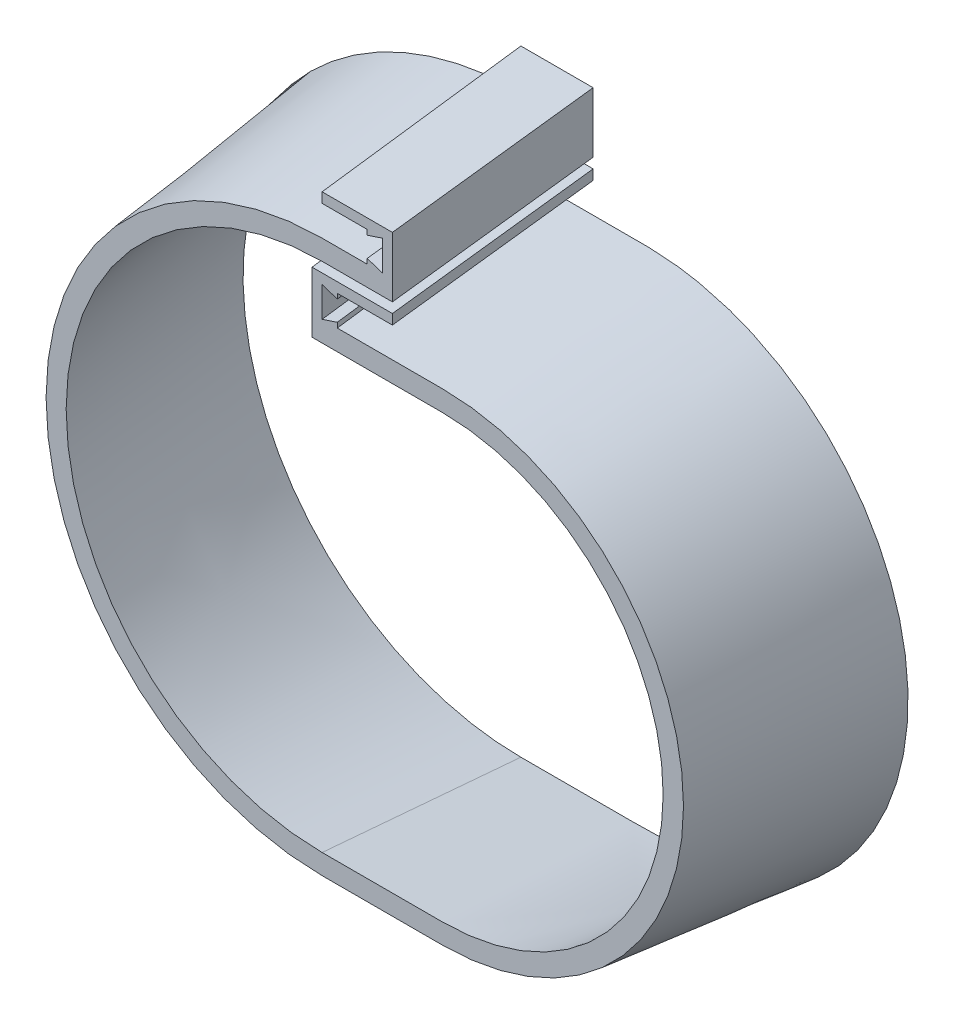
ISO-10303-21;
HEADER;
FILE_DESCRIPTION(('STEP AP214'),'2;1');
FILE_NAME('part.step','',(''),(''),'','','');
FILE_SCHEMA(('AUTOMOTIVE_DESIGN { 1 0 10303 214 1 1 1 1 }'));
ENDSEC;
DATA;
#1=APPLICATION_CONTEXT('core data for automotive mechanical design processes');
#2=APPLICATION_PROTOCOL_DEFINITION('international standard','automotive_design',2000,#1);
#3=PRODUCT_CONTEXT('',#1,'mechanical');
#4=PRODUCT('Part','Part','',(#3));
#5=PRODUCT_RELATED_PRODUCT_CATEGORY('part','',(#4));
#6=PRODUCT_DEFINITION_FORMATION('','',#4);
#7=PRODUCT_DEFINITION_CONTEXT('part definition',#1,'design');
#8=PRODUCT_DEFINITION('design','',#6,#7);
#9=PRODUCT_DEFINITION_SHAPE('','',#8);
#10=(LENGTH_UNIT() NAMED_UNIT(*) SI_UNIT(.MILLI.,.METRE.));
#11=(NAMED_UNIT(*) PLANE_ANGLE_UNIT() SI_UNIT($,.RADIAN.));
#12=(NAMED_UNIT(*) SI_UNIT($,.STERADIAN.) SOLID_ANGLE_UNIT());
#13=UNCERTAINTY_MEASURE_WITH_UNIT(LENGTH_MEASURE(1.E-05),#10,'distance_accuracy_value','');
#14=(GEOMETRIC_REPRESENTATION_CONTEXT(3) GLOBAL_UNCERTAINTY_ASSIGNED_CONTEXT((#13)) GLOBAL_UNIT_ASSIGNED_CONTEXT((#10,
#11,#12)) REPRESENTATION_CONTEXT('',''));
#15=CARTESIAN_POINT('',(0.,0.,0.));
#16=DIRECTION('',(0.,0.,1.));
#17=DIRECTION('',(1.,0.,0.));
#18=AXIS2_PLACEMENT_3D('',#15,#16,#17);
#19=CARTESIAN_POINT('',(0.,53.1735798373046,-203.2));
#20=CARTESIAN_POINT('',(0.,28.,0.));
#21=CARTESIAN_POINT('',(-0.668355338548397,53.1735798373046,-203.2));
#22=CARTESIAN_POINT('',(-0.500582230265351,28.,0.));
#23=CARTESIAN_POINT('',(-1.96098985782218,53.1735798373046,-203.2));
#24=CARTESIAN_POINT('',(-1.53725450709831,28.,0.));
#25=CARTESIAN_POINT('',(-3.86888532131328,53.1735798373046,-203.2));
#26=CARTESIAN_POINT('',(-3.12007524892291,28.,0.));
#27=CARTESIAN_POINT('',(-5.83422962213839,53.1735798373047,-203.2));
#28=CARTESIAN_POINT('',(-4.63550698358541,28.,0.));
#29=CARTESIAN_POINT('',(-7.25382722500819,53.1735798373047,-203.2));
#30=CARTESIAN_POINT('',(-5.56103893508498,28.,0.));
#31=CARTESIAN_POINT('',(-11.2539350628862,53.1735798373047,-203.2));
#32=CARTESIAN_POINT('',(-7.8151305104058,28.,0.));
#33=CARTESIAN_POINT('',(-17.7095674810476,52.5445178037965,-203.2));
#34=CARTESIAN_POINT('',(-11.4376437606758,27.6395927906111,0.));
#35=CARTESIAN_POINT('',(-27.0590501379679,49.7275389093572,-203.2));
#36=CARTESIAN_POINT('',(-16.6414565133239,26.0502756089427,0.));
#37=CARTESIAN_POINT('',(-35.706476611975,45.128848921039,-203.2));
#38=CARTESIAN_POINT('',(-21.4203750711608,23.4830088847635,0.));
#39=CARTESIAN_POINT('',(-43.3074213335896,38.9138126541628,-203.2));
#40=CARTESIAN_POINT('',(-25.5976422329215,20.0421946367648,0.));
#41=CARTESIAN_POINT('',(-49.5559760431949,31.3165376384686,-203.2));
#42=CARTESIAN_POINT('',(-29.0201461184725,15.8625819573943,0.));
#43=CARTESIAN_POINT('',(-54.1992552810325,22.6301976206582,-203.2));
#44=CARTESIAN_POINT('',(-31.5630913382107,11.1040231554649,0.));
#45=CARTESIAN_POINT('',(-57.0490058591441,13.1949083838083,-203.2));
#46=CARTESIAN_POINT('',(-33.1339162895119,5.94615417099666,0.));
#47=CARTESIAN_POINT('',(-57.9904942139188,3.38286307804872,-203.199999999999));
#48=CARTESIAN_POINT('',(-33.6750148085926,0.58215672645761,0.));
#49=CARTESIAN_POINT('',(-56.98772972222,-6.41800723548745,-203.200000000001));
#50=CARTESIAN_POINT('',(-33.1656164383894,-4.78745043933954,0.));
#51=CARTESIAN_POINT('',(-54.0849788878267,-15.8212241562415,-203.199999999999));
#52=CARTESIAN_POINT('',(-31.622450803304,-9.96149225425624,0.));
#53=CARTESIAN_POINT('',(-49.404317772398,-24.4587969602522,-203.200000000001));
#54=CARTESIAN_POINT('',(-29.0994535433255,-14.7448497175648,0.));
#55=CARTESIAN_POINT('',(-43.1395687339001,-31.9971350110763,-203.199999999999));
#56=CARTESIAN_POINT('',(-25.6862293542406,-18.9548199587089,0.));
#57=CARTESIAN_POINT('',(-35.5467520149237,-38.1512246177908,-203.200000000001));
#58=CARTESIAN_POINT('',(-21.5056616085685,-22.4275623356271,0.));
#59=CARTESIAN_POINT('',(-26.9320551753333,-42.6959292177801,-203.199999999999));
#60=CARTESIAN_POINT('',(-16.7102229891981,-25.0237161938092,0.));
#61=CARTESIAN_POINT('',(-17.6371943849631,-45.4746877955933,-203.2));
#62=CARTESIAN_POINT('',(-11.4775173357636,-26.6340198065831,0.));
#63=CARTESIAN_POINT('',(-11.2288774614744,-46.0939689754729,-203.2));
#64=CARTESIAN_POINT('',(-7.82908836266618,-27.,0.));
#65=CARTESIAN_POINT('',(-6.48966406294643,-46.0939689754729,-203.2));
#66=CARTESIAN_POINT('',(-5.11687034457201,-27.,0.));
#67=CARTESIAN_POINT('',(-3.79854600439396,-46.0939689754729,-203.2));
#68=CARTESIAN_POINT('',(-3.1987814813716,-27.,0.));
#69=CARTESIAN_POINT('',(-0.0774074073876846,-46.0939689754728,-203.2));
#70=CARTESIAN_POINT('',(0.0552786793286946,-27.,0.));
#71=CARTESIAN_POINT('',(3.66042093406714,-46.093968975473,-203.2));
#72=CARTESIAN_POINT('',(3.27023010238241,-27.,0.));
#73=CARTESIAN_POINT('',(6.38305686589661,-46.0939689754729,-203.2));
#74=CARTESIAN_POINT('',(5.13970488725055,-27.,0.));
#75=CARTESIAN_POINT('',(10.9239496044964,-46.0939689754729,-203.2));
#76=CARTESIAN_POINT('',(7.605722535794,-27.,0.));
#77=CARTESIAN_POINT('',(16.8603246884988,-45.5237132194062,-203.2));
#78=CARTESIAN_POINT('',(10.8025449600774,-26.6759504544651,0.));
#79=CARTESIAN_POINT('',(25.4927860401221,-42.9522317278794,-203.2));
#80=CARTESIAN_POINT('',(15.376007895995,-25.2651000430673,0.));
#81=CARTESIAN_POINT('',(33.5111608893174,-38.7322106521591,-203.2));
#82=CARTESIAN_POINT('',(19.5524112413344,-22.9924446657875,0.));
#83=CARTESIAN_POINT('',(40.589628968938,-33.002474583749,-203.2));
#84=CARTESIAN_POINT('',(23.1919844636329,-19.9689868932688,0.));
#85=CARTESIAN_POINT('',(46.4340801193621,-25.9700844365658,-203.2));
#86=CARTESIAN_POINT('',(26.1549570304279,-16.3057292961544,0.));
#87=CARTESIAN_POINT('',(50.7975750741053,-17.9023266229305,-203.2));
#88=CARTESIAN_POINT('',(28.3524152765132,-12.1530396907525,0.));
#89=CARTESIAN_POINT('',(53.4933671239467,-9.11543073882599,-203.2));
#90=CARTESIAN_POINT('',(29.6954455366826,-7.66128589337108,0.));
#91=CARTESIAN_POINT('',(54.4051365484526,0.039939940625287,-203.2));
#92=CARTESIAN_POINT('',(30.1533536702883,-2.99999999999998,0.));
#93=CARTESIAN_POINT('',(53.4933671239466,9.19531062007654,-203.2));
#94=CARTESIAN_POINT('',(29.6954455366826,1.66128589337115,0.));
#95=CARTESIAN_POINT('',(50.7975750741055,17.982206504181,-203.2));
#96=CARTESIAN_POINT('',(28.3524152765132,6.15303969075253,0.));
#97=CARTESIAN_POINT('',(46.4340801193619,26.0499643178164,-203.2));
#98=CARTESIAN_POINT('',(26.1549570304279,10.3057292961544,0.));
#99=CARTESIAN_POINT('',(40.5896289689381,33.0823544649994,-203.2));
#100=CARTESIAN_POINT('',(23.1919844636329,13.9689868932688,0.));
#101=CARTESIAN_POINT('',(33.5111608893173,38.8120905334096,-203.2));
#102=CARTESIAN_POINT('',(19.5524112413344,16.9924446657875,0.));
#103=CARTESIAN_POINT('',(25.4927860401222,43.0321116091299,-203.2));
#104=CARTESIAN_POINT('',(15.376007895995,19.2651000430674,0.));
#105=CARTESIAN_POINT('',(16.8603246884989,45.6035931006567,-203.2));
#106=CARTESIAN_POINT('',(10.8025449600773,20.6759504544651,0.));
#107=CARTESIAN_POINT('',(10.9239496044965,46.1738488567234,-203.2));
#108=CARTESIAN_POINT('',(7.605722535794,21.,0.));
#109=CARTESIAN_POINT('',(6.3830568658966,46.1738488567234,-203.2));
#110=CARTESIAN_POINT('',(5.13970488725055,21.,0.));
#111=CARTESIAN_POINT('',(3.54311215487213,46.1738488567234,-203.2));
#112=CARTESIAN_POINT('',(3.31388734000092,21.,0.));
#113=CARTESIAN_POINT('',(-0.356364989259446,46.1738488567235,-203.2));
#114=CARTESIAN_POINT('',(0.279864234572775,21.,0.));
#115=CARTESIAN_POINT('',(-4.13175471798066,46.1738488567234,-203.2));
#116=CARTESIAN_POINT('',(-2.916691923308,21.,0.));
#117=CARTESIAN_POINT('',(-6.69842836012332,46.1738488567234,-203.2));
#118=CARTESIAN_POINT('',(-5.00058223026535,21.,0.));
#119=CARTESIAN_POINT('',(-8.03280693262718,46.1738488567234,-203.2));
#120=CARTESIAN_POINT('',(-6.,21.,0.));
#121=B_SPLINE_SURFACE_WITH_KNOTS('',3,1,((#19,#20),(#21,#22),(#23,#24),(#25,#26),(#27,#28),(#29,
#30),(#31,#32),(#33,#34),(#35,#36),(#37,#38),(#39,#40),(#41,#42),(#43,#44),(#45,#46),(#47,#48),
(#49,#50),(#51,#52),(#53,#54),(#55,#56),(#57,#58),(#59,#60),(#61,#62),(#63,#64),(#65,#66),(#67,
#68),(#69,#70),(#71,#72),(#73,#74),(#75,#76),(#77,#78),(#79,#80),(#81,#82),(#83,#84),(#85,#86),
(#87,#88),(#89,#90),(#91,#92),(#93,#94),(#95,#96),(#97,#98),(#99,#100),(#101,#102),(#103,#104),
(#105,#106),(#107,#108),(#109,#110),(#111,#112),(#113,#114),(#115,#116),(#117,#118),(#119,
#120)),.UNSPECIFIED.,.F.,.F.,.F.,(4,1,1,1,2,1,1,1,1,1,1,1,1,1,1,1,1,1,1,1,2,1,1,1,2,1,1,1,1,1,1,
1,1,1,1,1,1,1,1,1,2,1,1,1,4),(2,2),(0.,0.00686077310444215,0.0137215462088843,
0.0205823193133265,0.0274430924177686,0.0558128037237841,0.0841825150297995,0.112552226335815,
0.14092193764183,0.169291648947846,0.197661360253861,0.226031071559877,0.254400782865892,
0.282770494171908,0.311140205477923,0.339509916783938,0.367879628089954,0.396249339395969,
0.424619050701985,0.452988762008,0.481358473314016,0.495056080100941,0.508753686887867,
0.522451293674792,0.536148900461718,0.561715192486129,0.587281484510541,0.612847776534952,
0.638414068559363,0.663980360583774,0.689546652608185,0.715112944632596,0.740679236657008,
0.766245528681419,0.79181182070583,0.817378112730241,0.842944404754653,0.868510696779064,
0.894076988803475,0.919643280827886,0.945209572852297,0.958907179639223,0.972604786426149,
0.986302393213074,1.),(0.,1.),.UNSPECIFIED.);
#122=CARTESIAN_POINT('',(-6.20007942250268,23.4777410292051,-20.));
#123=CARTESIAN_POINT('',(-5.74408336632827,23.4777410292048,-20.));
#124=CARTESIAN_POINT('',(-5.28808731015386,23.4777410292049,-20.));
#125=CARTESIAN_POINT('',(-4.37365584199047,23.4777410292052,-20.));
#126=CARTESIAN_POINT('',(-3.91522043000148,23.4777410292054,-20.));
#127=CARTESIAN_POINT('',(-2.99640735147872,23.4777410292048,-20.));
#128=CARTESIAN_POINT('',(-2.53602968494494,23.4777410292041,-20.));
#129=CARTESIAN_POINT('',(-1.6138291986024,23.4777410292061,-20.));
#130=CARTESIAN_POINT('',(-1.15200637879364,23.4777410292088,-20.));
#131=CARTESIAN_POINT('',(-0.227412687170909,23.4777410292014,-20.));
#132=CARTESIAN_POINT('',(0.235358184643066,23.4777410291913,-20.));
#133=CARTESIAN_POINT('',(0.929739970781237,23.477741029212,-20.));
#134=CARTESIAN_POINT('',(1.16135088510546,23.4777410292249,-20.));
#135=CARTESIAN_POINT('',(1.62457270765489,23.4777410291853,-20.));
#136=CARTESIAN_POINT('',(1.85618361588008,23.4777410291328,-20.));
#137=CARTESIAN_POINT('',(2.32521984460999,23.4777410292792,-20.));
#138=CARTESIAN_POINT('',(2.5626451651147,23.4777410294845,-20.));
#139=CARTESIAN_POINT('',(3.03749582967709,23.4777410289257,-20.));
#140=CARTESIAN_POINT('',(3.27492117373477,23.4777410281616,-20.));
#141=CARTESIAN_POINT('',(3.74963683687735,23.477741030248,-20.));
#142=CARTESIAN_POINT('',(3.98692715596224,23.4777410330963,-20.));
#143=CARTESIAN_POINT('',(4.3428626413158,23.4777410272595,-20.));
#144=CARTESIAN_POINT('',(4.46150780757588,23.4777410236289,-20.));
#145=CARTESIAN_POINT('',(4.69879803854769,23.4777410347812,-20.));
#146=CARTESIAN_POINT('',(4.81744310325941,23.477741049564,-20.));
#147=CARTESIAN_POINT('',(5.05457226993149,23.4777410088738,-20.));
#148=CARTESIAN_POINT('',(5.17305637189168,23.477740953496,-20.));
#149=CARTESIAN_POINT('',(5.41002495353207,23.4777411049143,-20.));
#150=CARTESIAN_POINT('',(5.52850943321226,23.4777413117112,-20.));
#151=CARTESIAN_POINT('',(5.70623648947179,23.4777408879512,-20.));
#152=CARTESIAN_POINT('',(5.76547906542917,23.4777406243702,-20.));
#153=CARTESIAN_POINT('',(5.88396437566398,23.477741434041,-20.));
#154=CARTESIAN_POINT('',(5.94320710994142,23.4777425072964,-20.));
#155=CARTESIAN_POINT('',(6.03207103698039,23.4777402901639,-20.));
#156=CARTESIAN_POINT('',(6.06169222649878,23.4777389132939,-20.));
#157=CARTESIAN_POINT('',(6.12093460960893,23.4777431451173,-20.));
#158=CARTESIAN_POINT('',(6.15055580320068,23.4777487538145,-20.));
#159=CARTESIAN_POINT('',(6.20979807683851,23.477733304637,-20.));
#160=CARTESIAN_POINT('',(6.23941915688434,23.4777122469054,-20.));
#161=CARTESIAN_POINT('',(6.2986609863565,23.4775513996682,-20.));
#162=CARTESIAN_POINT('',(6.32828173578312,23.4774116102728,-20.));
#163=CARTESIAN_POINT('',(6.41697409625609,23.4768466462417,-20.));
#164=CARTESIAN_POINT('',(6.47604484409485,23.4762759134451,-20.));
#165=CARTESIAN_POINT('',(6.59418127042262,23.474729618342,-20.));
#166=CARTESIAN_POINT('',(6.65324694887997,23.4737540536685,-20.));
#167=CARTESIAN_POINT('',(6.83043198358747,23.4702265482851,-20.));
#168=CARTESIAN_POINT('',(6.94853993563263,23.4670737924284,-20.));
#169=CARTESIAN_POINT('',(7.18469655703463,23.459165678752,-20.));
#170=CARTESIAN_POINT('',(7.30274522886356,23.4544103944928,-20.));
#171=CARTESIAN_POINT('',(7.53876712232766,23.4433006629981,-20.));
#172=CARTESIAN_POINT('',(7.65674034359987,23.4369462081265,-20.));
#173=CARTESIAN_POINT('',(8.01004504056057,23.4155160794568,-20.));
#174=CARTESIAN_POINT('',(8.24523662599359,23.3980577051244,-20.));
#175=CARTESIAN_POINT('',(8.71507364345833,23.3568001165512,-20.));
#176=CARTESIAN_POINT('',(8.94971904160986,23.3330005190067,-20.));
#177=CARTESIAN_POINT('',(9.4183194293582,23.2790787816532,-20.));
#178=CARTESIAN_POINT('',(9.65227431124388,23.2489557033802,-20.));
#179=CARTESIAN_POINT('',(10.1192729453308,23.1824152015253,-20.));
#180=CARTESIAN_POINT('',(10.3523167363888,23.1459980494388,-20.));
#181=CARTESIAN_POINT('',(10.9482344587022,23.0446206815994,-20.));
#182=CARTESIAN_POINT('',(11.3103484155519,22.9751325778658,-20.));
#183=CARTESIAN_POINT('',(12.0318853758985,22.8208182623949,-20.));
#184=CARTESIAN_POINT('',(12.3913031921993,22.7359678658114,-20.));
#185=CARTESIAN_POINT('',(13.1065362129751,22.551093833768,-20.));
#186=CARTESIAN_POINT('',(13.4623481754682,22.4510576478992,-20.));
#187=CARTESIAN_POINT('',(14.1694526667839,22.2360147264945,-20.));
#188=CARTESIAN_POINT('',(14.5207448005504,22.1210066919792,-20.));
#189=CARTESIAN_POINT('',(15.2153475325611,21.8771758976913,-20.));
#190=CARTESIAN_POINT('',(15.5586994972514,21.7484709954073,-20.));
#191=CARTESIAN_POINT('',(16.2394828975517,21.4767136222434,-20.));
#192=CARTESIAN_POINT('',(16.5769171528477,21.3336682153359,-20.));
#193=CARTESIAN_POINT('',(17.24535998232,21.0334908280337,-20.));
#194=CARTESIAN_POINT('',(17.5763701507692,20.8763623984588,-20.));
#195=CARTESIAN_POINT('',(18.231484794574,20.5483584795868,-20.));
#196=CARTESIAN_POINT('',(18.555589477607,20.3774834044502,-20.));
#197=CARTESIAN_POINT('',(19.3040882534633,19.9626106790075,-20.));
#198=CARTESIAN_POINT('',(19.7255736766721,19.7133405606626,-20.));
#199=CARTESIAN_POINT('',(20.5540383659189,19.1916380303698,-20.));
#200=CARTESIAN_POINT('',(20.9610151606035,18.9192016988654,-20.));
#201=CARTESIAN_POINT('',(21.7591577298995,18.3520279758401,-20.));
#202=CARTESIAN_POINT('',(22.1503227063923,18.0572894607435,-20.));
#203=CARTESIAN_POINT('',(22.9168551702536,17.4453814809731,-20.));
#204=CARTESIAN_POINT('',(23.2921649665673,17.1281397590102,-20.));
#205=CARTESIAN_POINT('',(24.0242968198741,16.4730168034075,-20.));
#206=CARTESIAN_POINT('',(24.3811200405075,16.1351368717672,-20.));
#207=CARTESIAN_POINT('',(25.0749475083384,15.4396884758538,-20.));
#208=CARTESIAN_POINT('',(25.4119523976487,15.082120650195,-20.));
#209=CARTESIAN_POINT('',(26.2284324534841,14.1652685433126,-20.));
#210=CARTESIAN_POINT('',(26.6950449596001,13.5943951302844,-20.));
#211=CARTESIAN_POINT('',(27.3576103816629,12.7104459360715,-20.));
#212=CARTESIAN_POINT('',(27.5722560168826,12.4111640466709,-20.));
#213=CARTESIAN_POINT('',(27.9888448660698,11.803767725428,-20.));
#214=CARTESIAN_POINT('',(28.1907849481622,11.4956511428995,-20.));
#215=CARTESIAN_POINT('',(28.7763856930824,10.559830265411,-20.));
#216=CARTESIAN_POINT('',(29.1405010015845,9.91975502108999,-20.));
#217=CARTESIAN_POINT('',(29.8135971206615,8.61124010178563,-20.));
#218=CARTESIAN_POINT('',(30.1225791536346,7.94280105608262,-20.));
#219=CARTESIAN_POINT('',(30.5427441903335,6.92195705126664,-20.));
#220=CARTESIAN_POINT('',(30.6756676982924,6.57837045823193,-20.));
#221=CARTESIAN_POINT('',(30.9268113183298,5.8859652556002,-20.));
#222=CARTESIAN_POINT('',(31.0450350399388,5.53714795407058,-20.));
#223=CARTESIAN_POINT('',(31.3775132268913,4.48357550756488,-20.));
#224=CARTESIAN_POINT('',(31.5695842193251,3.77167669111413,-20.));
#225=CARTESIAN_POINT('',(31.8933321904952,2.33412669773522,-20.));
#226=CARTESIAN_POINT('',(32.0249866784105,1.60847050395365,-20.));
#227=CARTESIAN_POINT('',(32.2268674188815,0.148572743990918,-20.));
#228=CARTESIAN_POINT('',(32.2970969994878,-0.585668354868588,-20.));
#229=CARTESIAN_POINT('',(32.3557098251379,-1.68929823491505,-20.));
#230=CARTESIAN_POINT('',(32.3674579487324,-2.0575813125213,-20.));
#231=CARTESIAN_POINT('',(32.37525580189,-2.7943137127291,-20.));
#232=CARTESIAN_POINT('',(32.3713055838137,-3.16276303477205,-20.));
#233=CARTESIAN_POINT('',(32.3359915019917,-4.26735056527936,-20.));
#234=CARTESIAN_POINT('',(32.2811716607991,-5.00286923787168,-20.));
#235=CARTESIAN_POINT('',(32.1099234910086,-6.46641350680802,-20.));
#236=CARTESIAN_POINT('',(31.9935104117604,-7.19444091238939,-20.));
#237=CARTESIAN_POINT('',(31.6999994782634,-8.63815068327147,-20.));
#238=CARTESIAN_POINT('',(31.52290226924,-9.35383317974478,-20.));
#239=CARTESIAN_POINT('',(31.1093423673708,-10.7670912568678,-20.));
#240=CARTESIAN_POINT('',(30.8729448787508,-11.4646858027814,-20.));
#241=CARTESIAN_POINT('',(30.4746894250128,-12.4939900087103,-20.));
#242=CARTESIAN_POINT('',(30.3346438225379,-12.8342788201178,-20.));
#243=CARTESIAN_POINT('',(30.0402302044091,-13.5086035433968,-20.));
#244=CARTESIAN_POINT('',(29.885862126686,-13.8426394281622,-20.));
#245=CARTESIAN_POINT('',(29.4017329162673,-14.8347047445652,-20.));
#246=CARTESIAN_POINT('',(29.0509701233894,-15.4826316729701,-20.));
#247=CARTESIAN_POINT('',(28.2963767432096,-16.7466938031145,-20.));
#248=CARTESIAN_POINT('',(27.8925458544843,-17.3628288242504,-20.));
#249=CARTESIAN_POINT('',(27.0347753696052,-18.55885817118,-20.));
#250=CARTESIAN_POINT('',(26.5808544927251,-19.1387659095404,-20.));
#251=CARTESIAN_POINT('',(25.6256991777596,-20.2583024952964,-20.));
#252=CARTESIAN_POINT('',(25.1244615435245,-20.7979286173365,-20.));
#253=CARTESIAN_POINT('',(24.0780620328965,-21.8324566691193,-20.));
#254=CARTESIAN_POINT('',(23.5329113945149,-22.3273699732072,-20.));
#255=CARTESIAN_POINT('',(22.403115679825,-23.2695167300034,-20.));
#256=CARTESIAN_POINT('',(21.8184841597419,-23.7167664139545,-20.));
#257=CARTESIAN_POINT('',(20.8146502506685,-24.4200532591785,-20.));
#258=CARTESIAN_POINT('',(20.4052180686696,-24.6901553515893,-20.));
#259=CARTESIAN_POINT('',(19.5717473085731,-25.2071490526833,-20.));
#260=CARTESIAN_POINT('',(19.147704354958,-25.4540336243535,-20.));
#261=CARTESIAN_POINT('',(18.2859333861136,-25.923939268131,-20.));
#262=CARTESIAN_POINT('',(17.8481893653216,-26.1469309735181,-20.));
#263=CARTESIAN_POINT('',(16.9612436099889,-26.5676584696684,-20.));
#264=CARTESIAN_POINT('',(16.5120534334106,-26.7654186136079,-20.));
#265=CARTESIAN_POINT('',(15.603572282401,-27.1350143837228,-20.));
#266=CARTESIAN_POINT('',(15.1442901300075,-27.3068716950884,-20.));
#267=CARTESIAN_POINT('',(14.2182882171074,-27.6239940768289,-20.));
#268=CARTESIAN_POINT('',(13.7515969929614,-27.7693425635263,-20.));
#269=CARTESIAN_POINT('',(12.7527085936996,-28.050074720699,-20.));
#270=CARTESIAN_POINT('',(12.219539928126,-28.1820104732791,-20.));
#271=CARTESIAN_POINT('',(11.1458214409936,-28.4121615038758,-20.));
#272=CARTESIAN_POINT('',(10.6052700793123,-28.5103696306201,-20.));
#273=CARTESIAN_POINT('',(9.79015611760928,-28.6321740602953,-20.));
#274=CARTESIAN_POINT('',(9.51744346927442,-28.6685494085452,-20.));
#275=CARTESIAN_POINT('',(8.97098846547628,-28.7327085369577,-20.));
#276=CARTESIAN_POINT('',(8.69724609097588,-28.7604921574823,-20.));
#277=CARTESIAN_POINT('',(8.28555712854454,-28.7957385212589,-20.));
#278=CARTESIAN_POINT('',(8.14787830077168,-28.8064303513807,-20.));
#279=CARTESIAN_POINT('',(7.87236434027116,-28.8256353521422,-20.));
#280=CARTESIAN_POINT('',(7.73452920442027,-28.8341484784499,-20.));
#281=CARTESIAN_POINT('',(7.45875207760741,-28.8489908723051,-20.));
#282=CARTESIAN_POINT('',(7.32081009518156,-28.8553202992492,-20.));
#283=CARTESIAN_POINT('',(7.04484922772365,-28.8657911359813,-20.));
#284=CARTESIAN_POINT('',(6.90683034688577,-28.8699326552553,-20.));
#285=CARTESIAN_POINT('',(6.69947187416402,-28.8745095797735,-20.));
#286=CARTESIAN_POINT('',(6.63014939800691,-28.8757635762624,-20.));
#287=CARTESIAN_POINT('',(6.49149703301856,-28.8777159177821,-20.));
#288=CARTESIAN_POINT('',(6.42216714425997,-28.8784142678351,-20.));
#289=CARTESIAN_POINT('',(6.31816840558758,-28.8790544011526,-20.));
#290=CARTESIAN_POINT('',(6.28350070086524,-28.8791998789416,-20.));
#291=CARTESIAN_POINT('',(6.21416497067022,-28.8793383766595,-20.));
#292=CARTESIAN_POINT('',(6.17949694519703,-28.8793313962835,-20.));
#293=CARTESIAN_POINT('',(6.07549258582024,-28.8793201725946,-20.));
#294=CARTESIAN_POINT('',(6.00615631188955,-28.8793256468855,-20.));
#295=CARTESIAN_POINT('',(5.86747919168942,-28.8793296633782,-20.));
#296=CARTESIAN_POINT('',(5.79813834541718,-28.8793282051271,-20.));
#297=CARTESIAN_POINT('',(5.6594568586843,-28.8793271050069,-20.));
#298=CARTESIAN_POINT('',(5.59011621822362,-28.8793274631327,-20.));
#299=CARTESIAN_POINT('',(5.38209723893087,-28.8793280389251,-20.));
#300=CARTESIAN_POINT('',(5.24341889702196,-28.8793277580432,-20.));
#301=CARTESIAN_POINT('',(4.96618394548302,-28.8793275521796,-20.));
#302=CARTESIAN_POINT('',(4.82762733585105,-28.8793276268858,-20.));
#303=CARTESIAN_POINT('',(4.55051327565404,-28.8793276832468,-20.));
#304=CARTESIAN_POINT('',(4.411955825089,-28.8793276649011,-20.));
#305=CARTESIAN_POINT('',(3.99629489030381,-28.8793276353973,-20.));
#306=CARTESIAN_POINT('',(3.71919140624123,-28.879327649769,-20.));
#307=CARTESIAN_POINT('',(3.16191805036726,-28.879327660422,-20.));
#308=CARTESIAN_POINT('',(2.88174817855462,-28.8793276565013,-20.));
#309=CARTESIAN_POINT('',(2.3214055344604,-28.8793276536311,-20.));
#310=CARTESIAN_POINT('',(2.04123276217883,-28.8793276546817,-20.));
#311=CARTESIAN_POINT('',(1.48162895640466,-28.8793276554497,-20.));
#312=CARTESIAN_POINT('',(1.20219792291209,-28.8793276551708,-20.));
#313=CARTESIAN_POINT('',(0.643336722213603,-28.8793276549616,-20.));
#314=CARTESIAN_POINT('',(0.363906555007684,-28.8793276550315,-20.));
#315=CARTESIAN_POINT('',(-0.194437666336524,-28.8793276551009,-20.));
#316=CARTESIAN_POINT('',(-0.473351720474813,-28.8793276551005,-20.));
#317=CARTESIAN_POINT('',(-1.03118040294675,-28.8793276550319,-20.));
#318=CARTESIAN_POINT('',(-1.3100950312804,-28.8793276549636,-20.));
#319=CARTESIAN_POINT('',(-1.86763291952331,-28.8793276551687,-20.));
#320=CARTESIAN_POINT('',(-2.14625617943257,-28.8793276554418,-20.));
#321=CARTESIAN_POINT('',(-2.70350126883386,-28.8793276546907,-20.));
#322=CARTESIAN_POINT('',(-2.98212309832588,-28.8793276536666,-20.));
#323=CARTESIAN_POINT('',(-3.53929756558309,-28.8793276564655,-20.));
#324=CARTESIAN_POINT('',(-3.81785020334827,-28.8793276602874,-20.));
#325=CARTESIAN_POINT('',(-4.23568198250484,-28.8793276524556,-20.));
#326=CARTESIAN_POINT('',(-4.37496112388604,-28.8793276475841,-20.));
#327=CARTESIAN_POINT('',(-4.65351890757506,-28.8793276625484,-20.));
#328=CARTESIAN_POINT('',(-4.79279754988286,-28.8793276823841,-20.));
#329=CARTESIAN_POINT('',(-5.07143563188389,-28.8793276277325,-20.));
#330=CARTESIAN_POINT('',(-5.21079507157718,-28.8793275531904,-20.));
#331=CARTESIAN_POINT('',(-5.4198351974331,-28.8793277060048,-20.));
#332=CARTESIAN_POINT('',(-5.48951588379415,-28.8793278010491,-20.));
#333=CARTESIAN_POINT('',(-5.62887718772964,-28.8793275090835,-20.));
#334=CARTESIAN_POINT('',(-5.69855780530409,-28.8793271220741,-20.));
#335=CARTESIAN_POINT('',(-5.83791618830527,-28.8793281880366,-20.));
#336=CARTESIAN_POINT('',(-5.90759395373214,-28.8793296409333,-20.));
#337=CARTESIAN_POINT('',(-6.01211072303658,-28.8793266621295,-20.));
#338=CARTESIAN_POINT('',(-6.04694972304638,-28.8793248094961,-20.));
#339=CARTESIAN_POINT('',(-6.11662774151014,-28.879330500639,-20.));
#340=CARTESIAN_POINT('',(-6.15146675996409,-28.8793380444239,-20.));
#341=CARTESIAN_POINT('',(-6.2211440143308,-28.879317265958,-20.));
#342=CARTESIAN_POINT('',(-6.25598225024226,-28.8792889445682,-20.));
#343=CARTESIAN_POINT('',(-6.32565826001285,-28.879088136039,-20.));
#344=CARTESIAN_POINT('',(-6.36049603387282,-28.8789156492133,-20.));
#345=CARTESIAN_POINT('',(-6.4650075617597,-28.8782194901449,-20.));
#346=CARTESIAN_POINT('',(-6.53468017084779,-28.8775171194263,-20.));
#347=CARTESIAN_POINT('',(-6.68835518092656,-28.8754215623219,-20.));
#348=CARTESIAN_POINT('',(-6.77235607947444,-28.8739159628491,-20.));
#349=CARTESIAN_POINT('',(-6.94034312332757,-28.8701920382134,-20.));
#350=CARTESIAN_POINT('',(-7.02432926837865,-28.8679737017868,-20.));
#351=CARTESIAN_POINT('',(-7.27625472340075,-28.8602479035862,-20.));
#352=CARTESIAN_POINT('',(-7.44416251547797,-28.8536696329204,-20.));
#353=CARTESIAN_POINT('',(-7.77974321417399,-28.8376682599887,-20.));
#354=CARTESIAN_POINT('',(-7.94741620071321,-28.8282468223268,-20.));
#355=CARTESIAN_POINT('',(-8.28257976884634,-28.8065619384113,-20.));
#356=CARTESIAN_POINT('',(-8.45007034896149,-28.7942984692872,-20.));
#357=CARTESIAN_POINT('',(-8.78475577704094,-28.7669394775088,-20.));
#358=CARTESIAN_POINT('',(-8.95195071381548,-28.7518450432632,-20.));
#359=CARTESIAN_POINT('',(-9.28605821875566,-28.7188261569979,-20.));
#360=CARTESIAN_POINT('',(-9.452970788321,-28.7009017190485,-20.));
#361=CARTESIAN_POINT('',(-9.95315186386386,-28.6428970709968,-20.));
#362=CARTESIAN_POINT('',(-10.2859394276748,-28.5985793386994,-20.));
#363=CARTESIAN_POINT('',(-10.949812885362,-28.4986860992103,-20.));
#364=CARTESIAN_POINT('',(-11.2808987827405,-28.4431106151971,-20.));
#365=CARTESIAN_POINT('',(-11.9367461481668,-28.3215189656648,-20.));
#366=CARTESIAN_POINT('',(-12.2615341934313,-28.2556462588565,-20.));
#367=CARTESIAN_POINT('',(-12.9089898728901,-28.1129779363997,-20.));
#368=CARTESIAN_POINT('',(-13.2316554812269,-28.0361731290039,-20.));
#369=CARTESIAN_POINT('',(-13.8744114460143,-27.8717524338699,-20.));
#370=CARTESIAN_POINT('',(-14.1945002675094,-27.7841305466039,-20.));
#371=CARTESIAN_POINT('',(-14.8316506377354,-27.5981919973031,-20.));
#372=CARTESIAN_POINT('',(-15.1487113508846,-27.4998724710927,-20.));
#373=CARTESIAN_POINT('',(-15.779351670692,-27.292671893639,-20.));
#374=CARTESIAN_POINT('',(-16.0929313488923,-27.1837910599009,-20.));
#375=CARTESIAN_POINT('',(-16.7950712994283,-26.9267223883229,-20.));
#376=CARTESIAN_POINT('',(-17.1825454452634,-26.7755562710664,-20.));
#377=CARTESIAN_POINT('',(-17.9505964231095,-26.4571061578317,-20.));
#378=CARTESIAN_POINT('',(-18.3311763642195,-26.2898296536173,-20.));
#379=CARTESIAN_POINT('',(-19.0848839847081,-25.9394818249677,-20.));
#380=CARTESIAN_POINT('',(-19.4580134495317,-25.7564143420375,-20.));
#381=CARTESIAN_POINT('',(-20.1962565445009,-25.3748041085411,-20.));
#382=CARTESIAN_POINT('',(-20.5613704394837,-25.1762618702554,-20.));
#383=CARTESIAN_POINT('',(-21.2857338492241,-24.7624562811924,-20.));
#384=CARTESIAN_POINT('',(-21.644916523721,-24.5470759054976,-20.));
#385=CARTESIAN_POINT('',(-22.3539033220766,-24.1012581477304,-20.));
#386=CARTESIAN_POINT('',(-22.7037057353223,-23.8708180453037,-20.));
#387=CARTESIAN_POINT('',(-23.393252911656,-23.3952785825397,-20.));
#388=CARTESIAN_POINT('',(-23.7329966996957,-23.1501778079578,-20.));
#389=CARTESIAN_POINT('',(-24.4018110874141,-22.6458326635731,-20.));
#390=CARTESIAN_POINT('',(-24.7308815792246,-22.3865881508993,-20.));
#391=CARTESIAN_POINT('',(-25.4844966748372,-21.7666331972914,-20.));
#392=CARTESIAN_POINT('',(-25.9047300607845,-21.4006603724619,-20.));
#393=CARTESIAN_POINT('',(-26.7238977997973,-20.6456848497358,-20.));
#394=CARTESIAN_POINT('',(-27.1228336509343,-20.2566837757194,-20.));
#395=CARTESIAN_POINT('',(-27.8981216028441,-19.4568017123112,-20.));
#396=CARTESIAN_POINT('',(-28.2744741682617,-19.0459211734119,-20.));
#397=CARTESIAN_POINT('',(-29.0024248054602,-18.2049061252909,-20.));
#398=CARTESIAN_POINT('',(-29.3540923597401,-17.7748317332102,-20.));
#399=CARTESIAN_POINT('',(-30.0328002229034,-16.8956422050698,-20.));
#400=CARTESIAN_POINT('',(-30.359839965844,-16.4465266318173,-20.));
#401=CARTESIAN_POINT('',(-30.9881323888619,-15.5306371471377,-20.));
#402=CARTESIAN_POINT('',(-31.2893849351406,-15.0638631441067,-20.));
#403=CARTESIAN_POINT('',(-32.009589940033,-13.8760331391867,-20.));
#404=CARTESIAN_POINT('',(-32.4118602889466,-13.1447832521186,-20.));
#405=CARTESIAN_POINT('',(-33.1535711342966,-11.650905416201,-20.));
#406=CARTESIAN_POINT('',(-33.4930024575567,-10.8882729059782,-20.));
#407=CARTESIAN_POINT('',(-33.9530551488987,-9.72466891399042,-20.));
#408=CARTESIAN_POINT('',(-34.0982994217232,-9.33327306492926,-20.));
#409=CARTESIAN_POINT('',(-34.3721303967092,-8.54482587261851,-20.));
#410=CARTESIAN_POINT('',(-34.5007229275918,-8.14777656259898,-20.));
#411=CARTESIAN_POINT('',(-34.7410773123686,-7.34861144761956,-20.));
#412=CARTESIAN_POINT('',(-34.8528389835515,-6.94649558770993,-20.));
#413=CARTESIAN_POINT('',(-35.0593595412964,-6.13780214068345,-20.));
#414=CARTESIAN_POINT('',(-35.1541127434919,-5.73122310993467,-20.));
#415=CARTESIAN_POINT('',(-35.4124121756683,-4.50613274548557,-20.));
#416=CARTESIAN_POINT('',(-35.5500742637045,-3.68201546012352,-20.));
#417=CARTESIAN_POINT('',(-35.755530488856,-2.0251452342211,-20.));
#418=CARTESIAN_POINT('',(-35.8233258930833,-1.19239245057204,-20.));
#419=CARTESIAN_POINT('',(-35.8722420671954,0.058551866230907,-20.));
#420=CARTESIAN_POINT('',(-35.8797508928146,0.475844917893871,-20.));
#421=CARTESIAN_POINT('',(-35.8771187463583,1.3103651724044,-20.));
#422=CARTESIAN_POINT('',(-35.8669776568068,1.72759237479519,-20.));
#423=CARTESIAN_POINT('',(-35.8101665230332,2.97809730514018,-20.));
#424=CARTESIAN_POINT('',(-35.7371159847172,3.8103880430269,-20.));
#425=CARTESIAN_POINT('',(-35.575284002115,5.05163826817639,-20.));
#426=CARTESIAN_POINT('',(-35.5126248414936,5.46421742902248,-20.));
#427=CARTESIAN_POINT('',(-35.369945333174,6.28637297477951,-20.));
#428=CARTESIAN_POINT('',(-35.2899250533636,6.69594937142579,-20.));
#429=CARTESIAN_POINT('',(-35.0240123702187,7.91901891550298,-20.));
#430=CARTESIAN_POINT('',(-34.8122442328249,8.72703559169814,-20.));
#431=CARTESIAN_POINT('',(-34.3216220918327,10.3221382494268,-20.));
#432=CARTESIAN_POINT('',(-34.0427830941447,11.1092288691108,-20.));
#433=CARTESIAN_POINT('',(-33.4196498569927,12.6570598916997,-20.));
#434=CARTESIAN_POINT('',(-33.0753557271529,13.4178003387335,-20.));
#435=CARTESIAN_POINT('',(-32.3241817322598,14.9072528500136,-20.));
#436=CARTESIAN_POINT('',(-31.9173400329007,15.6359840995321,-20.));
#437=CARTESIAN_POINT('',(-31.2622958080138,16.7012717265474,-20.));
#438=CARTESIAN_POINT('',(-31.036466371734,17.051756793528,-20.));
#439=CARTESIAN_POINT('',(-30.570173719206,17.7429251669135,-20.));
#440=CARTESIAN_POINT('',(-30.329708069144,18.0836068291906,-20.));
#441=CARTESIAN_POINT('',(-29.5868005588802,19.0904010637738,-20.));
#442=CARTESIAN_POINT('',(-29.0630003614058,19.741015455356,-20.));
#443=CARTESIAN_POINT('',(-28.2377418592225,20.6820832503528,-20.));
#444=CARTESIAN_POINT('',(-27.9559541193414,20.9900681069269,-20.));
#445=CARTESIAN_POINT('',(-27.3796215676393,21.5938612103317,-20.));
#446=CARTESIAN_POINT('',(-27.0850771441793,21.8896698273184,-20.));
#447=CARTESIAN_POINT('',(-26.1826379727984,22.7584597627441,-20.));
#448=CARTESIAN_POINT('',(-25.556258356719,23.3124391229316,-20.));
#449=CARTESIAN_POINT('',(-24.2591986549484,24.3656291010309,-20.));
#450=CARTESIAN_POINT('',(-23.5885240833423,24.8648465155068,-20.));
#451=CARTESIAN_POINT('',(-22.4387028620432,25.6473869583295,-20.));
#452=CARTESIAN_POINT('',(-21.9705889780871,25.9470429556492,-20.));
#453=CARTESIAN_POINT('',(-21.0182833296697,26.5196194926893,-20.));
#454=CARTESIAN_POINT('',(-20.5340921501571,26.7925410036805,-20.));
#455=CARTESIAN_POINT('',(-19.5512450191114,27.3107924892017,-20.));
#456=CARTESIAN_POINT('',(-19.0525912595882,27.5561266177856,-20.));
#457=CARTESIAN_POINT('',(-18.1688385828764,27.9605148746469,-20.));
#458=CARTESIAN_POINT('',(-17.7865723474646,28.1257907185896,-20.));
#459=CARTESIAN_POINT('',(-17.0153884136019,28.4400752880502,-20.));
#460=CARTESIAN_POINT('',(-16.6264705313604,28.5890835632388,-20.));
#461=CARTESIAN_POINT('',(-15.8426348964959,28.8706433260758,-20.));
#462=CARTESIAN_POINT('',(-15.4477159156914,29.0031913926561,-20.));
#463=CARTESIAN_POINT('',(-14.6525049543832,29.2516233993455,-20.));
#464=CARTESIAN_POINT('',(-14.2522109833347,29.3675009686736,-20.));
#465=CARTESIAN_POINT('',(-13.4453656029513,29.5827839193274,-20.));
#466=CARTESIAN_POINT('',(-13.0387946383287,29.6821160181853,-20.));
#467=CARTESIAN_POINT('',(-12.2218371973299,29.8634584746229,-20.));
#468=CARTESIAN_POINT('',(-11.8114510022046,29.9454700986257,-20.));
#469=CARTESIAN_POINT('',(-10.987805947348,30.0919929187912,-20.));
#470=CARTESIAN_POINT('',(-10.5745488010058,30.1565137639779,-20.));
#471=CARTESIAN_POINT('',(-9.74609491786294,30.2679992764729,-20.));
#472=CARTESIAN_POINT('',(-9.33090065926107,30.3149822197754,-20.));
#473=CARTESIAN_POINT('',(-8.76627720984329,30.3668484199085,-20.));
#474=CARTESIAN_POINT('',(-8.61752081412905,30.3793836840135,-20.));
#475=CARTESIAN_POINT('',(-8.31983314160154,30.4022116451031,-20.));
#476=CARTESIAN_POINT('',(-8.17090186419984,30.4125043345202,-20.));
#477=CARTESIAN_POINT('',(-7.87290732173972,30.4308431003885,-20.));
#478=CARTESIAN_POINT('',(-7.72384406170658,30.438889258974,-20.));
#479=CARTESIAN_POINT('',(-7.4256158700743,30.452732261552,-20.));
#480=CARTESIAN_POINT('',(-7.27645094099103,30.458529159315,-20.));
#481=CARTESIAN_POINT('',(-7.05260699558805,30.465536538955,-20.));
#482=CARTESIAN_POINT('',(-6.97795347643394,30.4675913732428,-20.));
#483=CARTESIAN_POINT('',(-6.82863332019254,30.4711370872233,-20.));
#484=CARTESIAN_POINT('',(-6.7539666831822,30.4726279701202,-20.));
#485=CARTESIAN_POINT('',(-6.60462241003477,30.4750444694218,-20.));
#486=CARTESIAN_POINT('',(-6.5299447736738,30.4759700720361,-20.));
#487=CARTESIAN_POINT('',(-6.41792465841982,30.4769368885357,-20.));
#488=CARTESIAN_POINT('',(-6.38058389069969,30.4771888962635,-20.));
#489=CARTESIAN_POINT('',(-6.30590160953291,30.4775477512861,-20.));
#490=CARTESIAN_POINT('',(-6.26856009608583,30.4776545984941,-20.));
#491=CARTESIAN_POINT('',(-6.1938503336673,30.4777417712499,-20.));
#492=CARTESIAN_POINT('',(-6.15648208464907,30.4777220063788,-20.));
#493=CARTESIAN_POINT('',(-6.08174560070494,30.4777070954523,-20.));
#494=CARTESIAN_POINT('',(-6.04437736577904,30.4777119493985,-20.));
#495=CARTESIAN_POINT('',(-5.93227276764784,30.4777197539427,-20.));
#496=CARTESIAN_POINT('',(-5.85753639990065,30.477715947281,-20.));
#497=CARTESIAN_POINT('',(-5.70806428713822,30.4777131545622,-20.));
#498=CARTESIAN_POINT('',(-5.63332854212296,30.4777141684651,-20.));
#499=CARTESIAN_POINT('',(-5.48385702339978,30.4777149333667,-20.));
#500=CARTESIAN_POINT('',(-5.40912124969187,30.477714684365,-20.));
#501=CARTESIAN_POINT('',(-5.18488642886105,30.4777142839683,-20.));
#502=CARTESIAN_POINT('',(-5.03538738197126,30.4777144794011,-20.));
#503=CARTESIAN_POINT('',(-4.73638893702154,30.4777146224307,-20.));
#504=CARTESIAN_POINT('',(-4.58688953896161,30.4777145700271,-20.));
#505=CARTESIAN_POINT('',(-4.28925711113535,30.4777145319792,-20.));
#506=CARTESIAN_POINT('',(-4.14112408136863,30.4777145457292,-20.));
#507=CARTESIAN_POINT('',(-3.84485811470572,30.4777145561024,-20.));
#508=CARTESIAN_POINT('',(-3.69672517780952,30.4777145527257,-20.));
#509=CARTESIAN_POINT('',(-3.25242583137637,30.4777145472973,-20.));
#510=CARTESIAN_POINT('',(-2.95625942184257,30.477714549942,-20.));
#511=CARTESIAN_POINT('',(-2.3641465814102,30.4777145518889,-20.));
#512=CARTESIAN_POINT('',(-2.06820015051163,30.4777145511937,-20.));
#513=CARTESIAN_POINT('',(-1.47664768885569,30.4777145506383,-20.));
#514=CARTESIAN_POINT('',(-1.18104165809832,30.4777145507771,-20.));
#515=CARTESIAN_POINT('',(-0.590290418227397,30.4777145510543,-20.));
#516=CARTESIAN_POINT('',(-0.295145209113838,30.4777145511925,-20.));
#517=CARTESIAN_POINT('',(0.,30.4777145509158,-20.));
#518=B_SPLINE_CURVE_WITH_KNOTS('',3,(#122,#123,#124,#125,#126,#127,#128,#129,#130,#131,#132,
#133,#134,#135,#136,#137,#138,#139,#140,#141,#142,#143,#144,#145,#146,#147,#148,#149,#150,#151,
#152,#153,#154,#155,#156,#157,#158,#159,#160,#161,#162,#163,#164,#165,#166,#167,#168,#169,#170,
#171,#172,#173,#174,#175,#176,#177,#178,#179,#180,#181,#182,#183,#184,#185,#186,#187,#188,#189,
#190,#191,#192,#193,#194,#195,#196,#197,#198,#199,#200,#201,#202,#203,#204,#205,#206,#207,#208,
#209,#210,#211,#212,#213,#214,#215,#216,#217,#218,#219,#220,#221,#222,#223,#224,#225,#226,#227,
#228,#229,#230,#231,#232,#233,#234,#235,#236,#237,#238,#239,#240,#241,#242,#243,#244,#245,#246,
#247,#248,#249,#250,#251,#252,#253,#254,#255,#256,#257,#258,#259,#260,#261,#262,#263,#264,#265,
#266,#267,#268,#269,#270,#271,#272,#273,#274,#275,#276,#277,#278,#279,#280,#281,#282,#283,#284,
#285,#286,#287,#288,#289,#290,#291,#292,#293,#294,#295,#296,#297,#298,#299,#300,#301,#302,#303,
#304,#305,#306,#307,#308,#309,#310,#311,#312,#313,#314,#315,#316,#317,#318,#319,#320,#321,#322,
#323,#324,#325,#326,#327,#328,#329,#330,#331,#332,#333,#334,#335,#336,#337,#338,#339,#340,#341,
#342,#343,#344,#345,#346,#347,#348,#349,#350,#351,#352,#353,#354,#355,#356,#357,#358,#359,#360,
#361,#362,#363,#364,#365,#366,#367,#368,#369,#370,#371,#372,#373,#374,#375,#376,#377,#378,#379,
#380,#381,#382,#383,#384,#385,#386,#387,#388,#389,#390,#391,#392,#393,#394,#395,#396,#397,#398,
#399,#400,#401,#402,#403,#404,#405,#406,#407,#408,#409,#410,#411,#412,#413,#414,#415,#416,#417,
#418,#419,#420,#421,#422,#423,#424,#425,#426,#427,#428,#429,#430,#431,#432,#433,#434,#435,#436,
#437,#438,#439,#440,#441,#442,#443,#444,#445,#446,#447,#448,#449,#450,#451,#452,#453,#454,#455,
#456,#457,#458,#459,#460,#461,#462,#463,#464,#465,#466,#467,#468,#469,#470,#471,#472,#473,#474,
#475,#476,#477,#478,#479,#480,#481,#482,#483,#484,#485,#486,#487,#488,#489,#490,#491,#492,#493,
#494,#495,#496,#497,#498,#499,#500,#501,#502,#503,#504,#505,#506,#507,#508,#509,#510,#511,#512,
#513,#514,#515,#516,#517),.UNSPECIFIED.,.F.,.F.,(4,2,2,2,2,2,2,2,2,2,2,2,2,2,2,2,2,2,2,2,2,2,2,
2,2,2,2,2,2,2,2,2,2,2,2,2,2,2,2,2,2,2,2,2,2,2,2,2,2,2,2,2,2,2,2,2,2,2,2,2,2,2,2,2,2,2,2,2,2,2,2,
2,2,2,2,2,2,2,2,2,2,2,2,2,2,2,2,2,2,2,2,2,2,2,2,2,2,2,2,2,2,2,2,2,2,2,2,2,2,2,2,2,2,2,2,2,2,2,2,
2,2,2,2,2,2,2,2,2,2,2,2,2,2,2,2,2,2,2,2,2,2,2,2,2,2,2,2,2,2,2,2,2,2,2,2,2,2,2,2,2,2,2,2,2,2,2,2,
2,2,2,2,2,2,2,2,2,2,2,2,2,2,2,2,2,2,2,2,2,2,2,2,2,2,2,2,2,2,4),(0.,1.36798816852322,
2.74329440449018,4.12442740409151,5.5098958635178,6.89820847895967,7.59304122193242,
8.28787394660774,9.0001499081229,9.71242594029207,10.4242968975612,10.780232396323,
11.1361675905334,11.4916198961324,11.8470733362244,12.0248010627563,12.2025292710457,
12.2913928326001,12.3802564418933,12.4691195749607,12.5579826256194,12.7352016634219,
12.9124217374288,13.2668600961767,13.6212821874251,13.9757059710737,14.6831279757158,
15.3905927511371,16.0981625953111,16.8057019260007,17.9115148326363,19.0190840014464,
20.1275735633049,21.2361593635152,22.3358779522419,23.4350574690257,24.5339606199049,
25.6328306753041,27.101068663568,28.569555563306,30.0381164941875,31.5116273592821,
32.9850453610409,34.4584155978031,36.6673073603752,37.7719342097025,38.8768322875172,
41.0832663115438,43.2896514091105,44.3945642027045,45.4992051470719,47.7084122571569,
49.9184411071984,52.1283502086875,53.2334747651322,54.3385956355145,56.5484154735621,
58.7576884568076,60.9669379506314,63.1737688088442,64.2774194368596,65.3810748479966,
67.5885786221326,69.7960949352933,72.0027890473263,74.209632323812,76.4159126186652,
78.6214391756,80.09224082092,81.5634868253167,83.0365208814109,84.5081222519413,85.978484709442,
87.4441373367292,89.0908099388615,90.7378314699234,91.5631066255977,92.388397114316,
92.802663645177,93.2169386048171,93.6311833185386,94.0454073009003,94.2534069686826,
94.4614047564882,94.5654084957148,94.6694124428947,94.8774213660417,95.0854438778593,
95.2934658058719,95.7095008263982,96.1251706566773,96.5408430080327,97.3721534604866,
98.2126630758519,99.0531813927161,99.8914744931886,100.729764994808,101.566507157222,
102.403251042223,103.239120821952,104.074986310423,104.910644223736,105.328481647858,
105.746317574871,106.164395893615,106.373437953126,106.582479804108,106.791513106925,
106.89603009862,107.000547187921,107.105061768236,107.209576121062,107.418602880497,
107.670642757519,107.92268661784,108.426769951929,108.930558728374,109.434351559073,
109.937951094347,110.441548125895,111.448514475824,112.455478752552,113.449493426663,
114.444348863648,115.439758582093,116.435435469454,117.43109185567,118.678462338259,
119.925255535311,121.171746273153,122.41819576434,123.674246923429,124.930525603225,
126.186925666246,127.443338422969,129.114180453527,130.784904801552,132.455594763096,
134.12137605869,135.78719562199,137.453023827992,139.953749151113,142.454839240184,
143.706957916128,144.958637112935,146.21032989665,147.462440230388,149.965871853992,
152.469258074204,153.721005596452,154.972761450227,157.475705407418,158.727341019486,
159.978971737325,162.481680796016,164.983830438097,167.485975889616,169.986600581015,
171.237091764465,172.487791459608,174.990059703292,176.242095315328,177.494092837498,
179.99954373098,182.504683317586,184.17129962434,185.837855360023,187.504159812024,
188.753207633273,190.002290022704,191.251631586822,192.501449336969,193.756663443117,
195.011785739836,196.266214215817,197.519331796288,197.967171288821,198.415012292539,
198.862836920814,199.310650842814,199.534694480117,199.758736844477,199.982784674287,
200.094809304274,200.206834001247,200.318938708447,200.431043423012,200.655252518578,
200.879459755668,201.10366707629,201.552164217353,202.000662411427,202.445061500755,
202.889460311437,203.777959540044,204.665798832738,205.552616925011,206.438052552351),.UNSPECIFIED.);
#519=CARTESIAN_POINT('',(-4.69007942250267,23.4777410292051,-20.));
#520=VERTEX_POINT('',#519);
#521=CARTESIAN_POINT('',(-1.51,30.4777145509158,-20.));
#522=VERTEX_POINT('',#521);
#523=EDGE_CURVE('E1044',#520,#522,#518,.T.);
#524=DIRECTION('',(0.00992758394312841,-0.122941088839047,0.992364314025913));
#525=VECTOR('',#524,1.);
#526=CARTESIAN_POINT('',(-6.01460519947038,39.8803866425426,-152.4));
#527=LINE('',#526,#525);
#528=CARTESIAN_POINT('',(-4.4899499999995,21.,0.));
#529=VERTEX_POINT('',#528);
#530=EDGE_CURVE('E367',#520,#529,#527,.T.);
#531=DIRECTION('',(1.,0.,0.));
#532=VECTOR('',#531,1.);
#533=CARTESIAN_POINT('',(0.,21.,0.));
#534=LINE('',#533,#532);
#535=CARTESIAN_POINT('',(6.00000000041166,21.,0.));
#536=VERTEX_POINT('',#535);
#537=EDGE_CURVE('E694',#529,#536,#534,.T.);
#538=CARTESIAN_POINT('',(6.,-3.,0.));
#539=DIRECTION('',(0.,0.,1.));
#540=DIRECTION('',(1.,0.,0.));
#541=AXIS2_PLACEMENT_3D('',#538,#539,#540);
#542=CIRCLE('',#541,24.);
#543=CARTESIAN_POINT('',(6.00000000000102,-27.,0.));
#544=VERTEX_POINT('',#543);
#545=EDGE_CURVE('E842',#536,#544,#542,.F.);
#546=DIRECTION('',(-1.,0.,0.));
#547=VECTOR('',#546,1.);
#548=CARTESIAN_POINT('',(0.,-27.,0.));
#549=LINE('',#548,#547);
#550=CARTESIAN_POINT('',(-6.00000000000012,-27.,0.));
#551=VERTEX_POINT('',#550);
#552=EDGE_CURVE('E1345',#544,#551,#549,.T.);
#553=CARTESIAN_POINT('',(-6.,0.500000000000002,0.));
#554=DIRECTION('',(0.,0.,1.));
#555=DIRECTION('',(1.,0.,0.));
#556=AXIS2_PLACEMENT_3D('',#553,#554,#555);
#557=CIRCLE('',#556,27.5);
#558=CARTESIAN_POINT('',(-6.00000000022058,28.,0.));
#559=VERTEX_POINT('',#558);
#560=EDGE_CURVE('E1259',#551,#559,#557,.F.);
#561=DIRECTION('',(-1.,0.,0.));
#562=VECTOR('',#561,1.);
#563=CARTESIAN_POINT('',(0.,28.,0.));
#564=LINE('',#563,#562);
#565=CARTESIAN_POINT('',(-1.51,28.,0.));
#566=VERTEX_POINT('',#565);
#567=EDGE_CURVE('E682',#566,#559,#564,.T.);
#568=DIRECTION('',(0.,-0.122945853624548,0.992413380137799));
#569=VECTOR('',#568,1.);
#570=CARTESIAN_POINT('',(-1.51,53.1735798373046,-203.2));
#571=LINE('',#570,#569);
#572=EDGE_CURVE('E691',#522,#566,#571,.T.);
#573=ORIENTED_EDGE('',*,*,#523,.F.);
#574=ORIENTED_EDGE('',*,*,#530,.T.);
#575=ORIENTED_EDGE('',*,*,#537,.T.);
#576=ORIENTED_EDGE('',*,*,#545,.T.);
#577=ORIENTED_EDGE('',*,*,#552,.T.);
#578=ORIENTED_EDGE('',*,*,#560,.T.);
#579=ORIENTED_EDGE('',*,*,#567,.F.);
#580=ORIENTED_EDGE('',*,*,#572,.F.);
#581=EDGE_LOOP('',(#573,#574,#575,#576,#577,#578,#579,#580));
#582=FACE_BOUND('',#581,.T.);
#583=ADVANCED_FACE('F341',(#582),#121,.T.);
#584=CARTESIAN_POINT('',(0.,0.,0.));
#585=DIRECTION('',(0.,0.,-1.));
#586=DIRECTION('',(-1.,0.,0.));
#587=AXIS2_PLACEMENT_3D('',#584,#585,#586);
#588=PLANE('',#587);
#589=DIRECTION('',(0.,-1.,0.));
#590=VECTOR('',#589,1.);
#591=CARTESIAN_POINT('',(-6.00000000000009,28.,0.));
#592=LINE('',#591,#590);
#593=CARTESIAN_POINT('',(-5.99999999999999,31.2,0.));
#594=VERTEX_POINT('',#593);
#595=CARTESIAN_POINT('',(-6.,31.,0.));
#596=VERTEX_POINT('',#595);
#597=EDGE_CURVE('E1101',#594,#596,#592,.T.);
#598=ORIENTED_EDGE('',*,*,#597,.T.);
#599=DIRECTION('',(1.,0.,0.));
#600=VECTOR('',#599,1.);
#601=CARTESIAN_POINT('',(0.,31.,0.));
#602=LINE('',#601,#600);
#603=CARTESIAN_POINT('',(-1.51,31.,0.));
#604=VERTEX_POINT('',#603);
#605=EDGE_CURVE('E1096',#596,#604,#602,.T.);
#606=ORIENTED_EDGE('',*,*,#605,.T.);
#607=DIRECTION('',(0.,1.,0.));
#608=VECTOR('',#607,1.);
#609=CARTESIAN_POINT('',(-1.50999999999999,0.,0.));
#610=LINE('',#609,#608);
#611=CARTESIAN_POINT('',(-1.51,30.5,0.));
#612=VERTEX_POINT('',#611);
#613=EDGE_CURVE('E1078',#612,#604,#610,.T.);
#614=ORIENTED_EDGE('',*,*,#613,.F.);
#615=DIRECTION('',(-0.949310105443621,-0.314341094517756,0.));
#616=VECTOR('',#615,1.);
#617=CARTESIAN_POINT('',(-9.25062250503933,27.9368799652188,0.));
#618=LINE('',#617,#616);
#619=CARTESIAN_POINT('',(0.,31.,0.));
#620=VERTEX_POINT('',#619);
#621=EDGE_CURVE('E1076',#620,#612,#618,.T.);
#622=ORIENTED_EDGE('',*,*,#621,.F.);
#623=DIRECTION('',(0.,-1.,0.));
#624=VECTOR('',#623,1.);
#625=CARTESIAN_POINT('',(0.,0.,0.));
#626=LINE('',#625,#624);
#627=CARTESIAN_POINT('',(0.,28.,0.));
#628=VERTEX_POINT('',#627);
#629=EDGE_CURVE('E1092',#620,#628,#626,.T.);
#630=ORIENTED_EDGE('',*,*,#629,.T.);
#631=DIRECTION('',(-0.949310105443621,0.314341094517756,0.));
#632=VECTOR('',#631,1.);
#633=CARTESIAN_POINT('',(8.35540097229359,25.2333109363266,0.));
#634=LINE('',#633,#632);
#635=CARTESIAN_POINT('',(-1.51,28.5,0.));
#636=VERTEX_POINT('',#635);
#637=EDGE_CURVE('E1107',#628,#636,#634,.T.);
#638=ORIENTED_EDGE('',*,*,#637,.T.);
#639=DIRECTION('',(0.,-1.,0.));
#640=VECTOR('',#639,1.);
#641=CARTESIAN_POINT('',(-1.51,0.,0.));
#642=LINE('',#641,#640);
#643=EDGE_CURVE('E1450',#636,#566,#642,.T.);
#644=ORIENTED_EDGE('',*,*,#643,.T.);
#645=ORIENTED_EDGE('',*,*,#567,.T.);
#646=ORIENTED_EDGE('',*,*,#560,.F.);
#647=ORIENTED_EDGE('',*,*,#552,.F.);
#648=ORIENTED_EDGE('',*,*,#545,.F.);
#649=ORIENTED_EDGE('',*,*,#537,.F.);
#650=DIRECTION('',(0.,1.,0.));
#651=VECTOR('',#650,1.);
#652=CARTESIAN_POINT('',(-4.49,21.5,0.));
#653=LINE('',#652,#651);
#654=CARTESIAN_POINT('',(-4.49,21.5,0.));
#655=VERTEX_POINT('',#654);
#656=EDGE_CURVE('E844',#529,#655,#653,.T.);
#657=ORIENTED_EDGE('',*,*,#656,.T.);
#658=DIRECTION('',(-0.949310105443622,-0.314341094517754,0.));
#659=VECTOR('',#658,1.);
#660=CARTESIAN_POINT('',(-6.,21.,0.));
#661=LINE('',#660,#659);
#662=CARTESIAN_POINT('',(-6.,21.,0.));
#663=VERTEX_POINT('',#662);
#664=EDGE_CURVE('E542',#655,#663,#661,.T.);
#665=ORIENTED_EDGE('',*,*,#664,.T.);
#666=DIRECTION('',(0.,-1.,0.));
#667=VECTOR('',#666,1.);
#668=CARTESIAN_POINT('',(-6.,0.,0.));
#669=LINE('',#668,#667);
#670=CARTESIAN_POINT('',(-6.,24.,0.));
#671=VERTEX_POINT('',#670);
#672=EDGE_CURVE('E734',#671,#663,#669,.T.);
#673=ORIENTED_EDGE('',*,*,#672,.F.);
#674=DIRECTION('',(0.949310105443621,-0.314341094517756,0.));
#675=VECTOR('',#674,1.);
#676=CARTESIAN_POINT('',(6.56891031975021,19.8381091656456,0.));
#677=LINE('',#676,#675);
#678=CARTESIAN_POINT('',(-4.49,23.5,0.));
#679=VERTEX_POINT('',#678);
#680=EDGE_CURVE('E728',#671,#679,#677,.T.);
#681=ORIENTED_EDGE('',*,*,#680,.T.);
#682=DIRECTION('',(0.,-1.,0.));
#683=VECTOR('',#682,1.);
#684=CARTESIAN_POINT('',(-4.49,0.,0.));
#685=LINE('',#684,#683);
#686=CARTESIAN_POINT('',(-4.49,24.,0.));
#687=VERTEX_POINT('',#686);
#688=EDGE_CURVE('E711',#687,#679,#685,.T.);
#689=ORIENTED_EDGE('',*,*,#688,.F.);
#690=DIRECTION('',(-1.,0.,0.));
#691=VECTOR('',#690,1.);
#692=CARTESIAN_POINT('',(0.,24.,0.));
#693=LINE('',#692,#691);
#694=CARTESIAN_POINT('',(1.,24.,0.));
#695=VERTEX_POINT('',#694);
#696=EDGE_CURVE('E708',#695,#687,#693,.T.);
#697=ORIENTED_EDGE('',*,*,#696,.F.);
#698=DIRECTION('',(0.,-1.,0.));
#699=VECTOR('',#698,1.);
#700=CARTESIAN_POINT('',(1.00000000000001,0.,0.));
#701=LINE('',#700,#699);
#702=CARTESIAN_POINT('',(1.,25.,0.));
#703=VERTEX_POINT('',#702);
#704=EDGE_CURVE('E710',#703,#695,#701,.T.);
#705=ORIENTED_EDGE('',*,*,#704,.F.);
#706=DIRECTION('',(1.,0.,0.));
#707=VECTOR('',#706,1.);
#708=CARTESIAN_POINT('',(0.,25.,0.));
#709=LINE('',#708,#707);
#710=CARTESIAN_POINT('',(-7.,25.,0.));
#711=VERTEX_POINT('',#710);
#712=EDGE_CURVE('E715',#711,#703,#709,.T.);
#713=ORIENTED_EDGE('',*,*,#712,.F.);
#714=DIRECTION('',(0.,1.,0.));
#715=VECTOR('',#714,1.);
#716=CARTESIAN_POINT('',(-7.,0.,0.));
#717=LINE('',#716,#715);
#718=CARTESIAN_POINT('',(-7.,18.9499796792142,0.));
#719=VERTEX_POINT('',#718);
#720=EDGE_CURVE('E719',#719,#711,#717,.T.);
#721=ORIENTED_EDGE('',*,*,#720,.F.);
#722=DIRECTION('',(-1.,0.,0.));
#723=VECTOR('',#722,1.);
#724=CARTESIAN_POINT('',(0.,18.9499796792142,0.));
#725=LINE('',#724,#723);
#726=CARTESIAN_POINT('',(-6.,18.9499796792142,0.));
#727=VERTEX_POINT('',#726);
#728=EDGE_CURVE('E723',#727,#719,#725,.T.);
#729=ORIENTED_EDGE('',*,*,#728,.F.);
#730=DIRECTION('',(1.,0.,0.));
#731=VECTOR('',#730,1.);
#732=CARTESIAN_POINT('',(0.,18.9499796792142,0.));
#733=LINE('',#732,#731);
#734=CARTESIAN_POINT('',(5.9999999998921,18.9499796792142,0.));
#735=VERTEX_POINT('',#734);
#736=EDGE_CURVE('E564',#727,#735,#733,.T.);
#737=ORIENTED_EDGE('',*,*,#736,.T.);
#738=CARTESIAN_POINT('',(6.,-3.02501016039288,0.));
#739=DIRECTION('',(0.,0.,1.));
#740=DIRECTION('',(1.,0.,0.));
#741=AXIS2_PLACEMENT_3D('',#738,#739,#740);
#742=CIRCLE('',#741,21.9749898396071);
#743=CARTESIAN_POINT('',(6.00000000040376,-25.,0.));
#744=VERTEX_POINT('',#743);
#745=EDGE_CURVE('E684',#735,#744,#742,.F.);
#746=ORIENTED_EDGE('',*,*,#745,.T.);
#747=DIRECTION('',(-1.,0.,0.));
#748=VECTOR('',#747,1.);
#749=CARTESIAN_POINT('',(0.,-25.,0.));
#750=LINE('',#749,#748);
#751=CARTESIAN_POINT('',(-6.00000000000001,-25.,0.));
#752=VERTEX_POINT('',#751);
#753=EDGE_CURVE('E633',#744,#752,#750,.T.);
#754=ORIENTED_EDGE('',*,*,#753,.T.);
#755=CARTESIAN_POINT('',(-6.00000000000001,0.500000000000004,0.));
#756=DIRECTION('',(0.,0.,1.));
#757=DIRECTION('',(1.,0.,0.));
#758=AXIS2_PLACEMENT_3D('',#755,#756,#757);
#759=CIRCLE('',#758,25.5);
#760=CARTESIAN_POINT('',(-5.99999999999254,26.,0.));
#761=VERTEX_POINT('',#760);
#762=EDGE_CURVE('E647',#761,#752,#759,.T.);
#763=ORIENTED_EDGE('',*,*,#762,.F.);
#764=DIRECTION('',(-1.,0.,0.));
#765=VECTOR('',#764,1.);
#766=CARTESIAN_POINT('',(0.,26.,0.));
#767=LINE('',#766,#765);
#768=CARTESIAN_POINT('',(0.,26.,0.));
#769=VERTEX_POINT('',#768);
#770=EDGE_CURVE('E658',#769,#761,#767,.T.);
#771=ORIENTED_EDGE('',*,*,#770,.F.);
#772=DIRECTION('',(1.,0.,0.));
#773=VECTOR('',#772,1.);
#774=CARTESIAN_POINT('',(0.,26.,0.));
#775=LINE('',#774,#773);
#776=CARTESIAN_POINT('',(1.,26.,0.));
#777=VERTEX_POINT('',#776);
#778=EDGE_CURVE('E1095',#769,#777,#775,.T.);
#779=ORIENTED_EDGE('',*,*,#778,.T.);
#780=DIRECTION('',(0.,1.,0.));
#781=VECTOR('',#780,1.);
#782=CARTESIAN_POINT('',(1.,31.,0.));
#783=LINE('',#782,#781);
#784=CARTESIAN_POINT('',(1.,28.6666666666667,0.));
#785=VERTEX_POINT('',#784);
#786=EDGE_CURVE('E1189',#777,#785,#783,.T.);
#787=ORIENTED_EDGE('',*,*,#786,.T.);
#788=CARTESIAN_POINT('',(1.,31.3333333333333,0.));
#789=VERTEX_POINT('',#788);
#790=EDGE_CURVE('E1191',#785,#789,#783,.T.);
#791=ORIENTED_EDGE('',*,*,#790,.T.);
#792=CARTESIAN_POINT('',(1.,32.,0.));
#793=VERTEX_POINT('',#792);
#794=EDGE_CURVE('E1203',#789,#793,#783,.T.);
#795=ORIENTED_EDGE('',*,*,#794,.T.);
#796=DIRECTION('',(-1.,0.,0.));
#797=VECTOR('',#796,1.);
#798=CARTESIAN_POINT('',(1.,32.,0.));
#799=LINE('',#798,#797);
#800=CARTESIAN_POINT('',(-6.,32.,0.));
#801=VERTEX_POINT('',#800);
#802=EDGE_CURVE('E1121',#793,#801,#799,.T.);
#803=ORIENTED_EDGE('',*,*,#802,.T.);
#804=EDGE_CURVE('E1118',#801,#594,#592,.T.);
#805=ORIENTED_EDGE('',*,*,#804,.T.);
#806=EDGE_LOOP('',(#598,#606,#614,#622,#630,#638,#644,#645,#646,#647,#648,#649,#657,#665,#673,
#681,#689,#697,#705,#713,#721,#729,#737,#746,#754,#763,#771,#779,#787,#791,#795,#803,#805));
#807=FACE_BOUND('',#806,.T.);
#808=ADVANCED_FACE('F343',(#807),#588,.F.);
#809=CARTESIAN_POINT('',(0.967197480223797,51.1738488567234,-203.2));
#810=DIRECTION('',(0.999999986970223,0.,-0.00016142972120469));
#811=DIRECTION('',(0.,1.,0.));
#812=AXIS2_PLACEMENT_3D('',#809,#810,#811);
#813=PLANE('',#812);
#814=DIRECTION('',(0.,-1.,0.));
#815=VECTOR('',#814,1.);
#816=CARTESIAN_POINT('',(0.996771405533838,51.1738488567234,-20.));
#817=LINE('',#816,#815);
#818=CARTESIAN_POINT('',(0.996771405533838,34.4777145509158,-20.));
#819=VERTEX_POINT('',#818);
#820=CARTESIAN_POINT('',(0.996771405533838,28.4777410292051,-20.));
#821=VERTEX_POINT('',#820);
#822=EDGE_CURVE('E544',#819,#821,#817,.T.);
#823=ORIENTED_EDGE('',*,*,#822,.F.);
#824=DIRECTION('',(0.000160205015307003,-0.122945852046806,0.992413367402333));
#825=VECTOR('',#824,1.);
#826=CARTESIAN_POINT('',(0.983598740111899,44.5867899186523,-101.6));
#827=LINE('',#826,#825);
#828=EDGE_CURVE('E346',#819,#793,#827,.T.);
#829=ORIENTED_EDGE('',*,*,#828,.T.);
#830=ORIENTED_EDGE('',*,*,#794,.F.);
#831=ORIENTED_EDGE('',*,*,#790,.F.);
#832=ORIENTED_EDGE('',*,*,#786,.F.);
#833=DIRECTION('',(-0.000160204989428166,0.122947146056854,-0.992413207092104));
#834=VECTOR('',#833,1.);
#835=CARTESIAN_POINT('',(0.983598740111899,38.5869244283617,-101.6));
#836=LINE('',#835,#834);
#837=EDGE_CURVE('E1187',#777,#821,#836,.T.);
#838=ORIENTED_EDGE('',*,*,#837,.T.);
#839=EDGE_LOOP('',(#823,#829,#830,#831,#832,#838));
#840=FACE_BOUND('',#839,.T.);
#841=ADVANCED_FACE('F1387',(#840),#813,.T.);
#842=CARTESIAN_POINT('',(0.967197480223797,57.1735798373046,-203.2));
#843=DIRECTION('',(0.,0.992413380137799,0.122945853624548));
#844=DIRECTION('',(-1.,0.,0.));
#845=AXIS2_PLACEMENT_3D('',#842,#843,#844);
#846=PLANE('',#845);
#847=DIRECTION('',(1.,0.,0.));
#848=VECTOR('',#847,1.);
#849=CARTESIAN_POINT('',(0.967197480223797,34.4777145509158,-20.));
#850=LINE('',#849,#848);
#851=CARTESIAN_POINT('',(-6.20007942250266,34.4777145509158,-20.));
#852=VERTEX_POINT('',#851);
#853=EDGE_CURVE('E547',#852,#819,#850,.T.);
#854=ORIENTED_EDGE('',*,*,#853,.F.);
#855=DIRECTION('',(0.00992758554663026,-0.122939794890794,0.992364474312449));
#856=VECTOR('',#855,1.);
#857=CARTESIAN_POINT('',(-7.01640346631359,44.5867899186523,-101.6));
#858=LINE('',#857,#856);
#859=EDGE_CURVE('E1082',#852,#801,#858,.T.);
#860=ORIENTED_EDGE('',*,*,#859,.T.);
#861=ORIENTED_EDGE('',*,*,#802,.F.);
#862=ORIENTED_EDGE('',*,*,#828,.F.);
#863=EDGE_LOOP('',(#854,#860,#861,#862));
#864=FACE_BOUND('',#863,.T.);
#865=ADVANCED_FACE('F1167',(#864),#846,.T.);
#866=CARTESIAN_POINT('',(-0.0328025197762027,51.1738488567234,-203.2));
#867=DIRECTION('',(0.,-0.992413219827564,-0.122947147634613));
#868=DIRECTION('',(1.,0.,0.));
#869=AXIS2_PLACEMENT_3D('',#866,#867,#868);
#870=PLANE('',#869);
#871=DIRECTION('',(-1.,0.,0.));
#872=VECTOR('',#871,1.);
#873=CARTESIAN_POINT('',(-0.0328025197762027,28.4777410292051,-20.));
#874=LINE('',#873,#872);
#875=CARTESIAN_POINT('',(-0.00322859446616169,28.4777410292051,-20.));
#876=VERTEX_POINT('',#875);
#877=EDGE_CURVE('E1439',#821,#876,#874,.T.);
#878=ORIENTED_EDGE('',*,*,#877,.F.);
#879=ORIENTED_EDGE('',*,*,#837,.F.);
#880=ORIENTED_EDGE('',*,*,#778,.F.);
#881=DIRECTION('',(0.000160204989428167,-0.122947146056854,0.992413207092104));
#882=VECTOR('',#881,1.);
#883=CARTESIAN_POINT('',(-0.0164012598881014,38.5869244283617,-101.6));
#884=LINE('',#883,#882);
#885=EDGE_CURVE('E565',#876,#769,#884,.T.);
#886=ORIENTED_EDGE('',*,*,#885,.F.);
#887=EDGE_LOOP('',(#878,#879,#880,#886));
#888=FACE_BOUND('',#887,.T.);
#889=ADVANCED_FACE('F1161',(#888),#870,.T.);
#890=CARTESIAN_POINT('',(-8.03280693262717,57.1735798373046,-203.2));
#891=DIRECTION('',(-0.999949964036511,0.,0.0100034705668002));
#892=DIRECTION('',(0.,-1.,0.));
#893=AXIS2_PLACEMENT_3D('',#890,#891,#892);
#894=PLANE('',#893);
#895=DIRECTION('',(0.,1.,0.));
#896=VECTOR('',#895,1.);
#897=CARTESIAN_POINT('',(-6.2000794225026,57.1735798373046,-20.));
#898=LINE('',#897,#896);
#899=CARTESIAN_POINT('',(-6.20007942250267,33.4777145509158,-20.));
#900=VERTEX_POINT('',#899);
#901=EDGE_CURVE('E1031',#900,#852,#898,.T.);
#902=ORIENTED_EDGE('',*,*,#901,.F.);
#903=DIRECTION('',(0.00992758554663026,-0.122939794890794,0.992364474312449));
#904=VECTOR('',#903,1.);
#905=CARTESIAN_POINT('',(-8.03280693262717,56.1735798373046,-203.2));
#906=LINE('',#905,#904);
#907=EDGE_CURVE('E1079',#900,#596,#906,.T.);
#908=ORIENTED_EDGE('',*,*,#907,.T.);
#909=ORIENTED_EDGE('',*,*,#597,.F.);
#910=ORIENTED_EDGE('',*,*,#804,.F.);
#911=ORIENTED_EDGE('',*,*,#859,.F.);
#912=EDGE_LOOP('',(#902,#908,#909,#910,#911));
#913=FACE_BOUND('',#912,.T.);
#914=ADVANCED_FACE('F1141',(#913),#894,.T.);
#915=CARTESIAN_POINT('',(-1.50999999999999,0.,0.));
#916=DIRECTION('',(-1.,0.,0.));
#917=DIRECTION('',(0.,-1.,0.));
#918=AXIS2_PLACEMENT_3D('',#915,#916,#917);
#919=PLANE('',#918);
#920=DIRECTION('',(0.,1.,0.));
#921=VECTOR('',#920,1.);
#922=CARTESIAN_POINT('',(-1.50999999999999,0.,-20.));
#923=LINE('',#922,#921);
#924=CARTESIAN_POINT('',(-1.51,32.9777145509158,-20.));
#925=VERTEX_POINT('',#924);
#926=CARTESIAN_POINT('',(-1.51,33.4777145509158,-20.));
#927=VERTEX_POINT('',#926);
#928=EDGE_CURVE('E1012',#925,#927,#923,.T.);
#929=ORIENTED_EDGE('',*,*,#928,.F.);
#930=DIRECTION('',(0.,-0.122945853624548,0.992413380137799));
#931=VECTOR('',#930,1.);
#932=CARTESIAN_POINT('',(-1.51,55.6735798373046,-203.2));
#933=LINE('',#932,#931);
#934=EDGE_CURVE('E1072',#925,#612,#933,.T.);
#935=ORIENTED_EDGE('',*,*,#934,.T.);
#936=ORIENTED_EDGE('',*,*,#613,.T.);
#937=DIRECTION('',(0.,-0.122945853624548,0.992413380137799));
#938=VECTOR('',#937,1.);
#939=CARTESIAN_POINT('',(-1.51,56.1735798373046,-203.2));
#940=LINE('',#939,#938);
#941=EDGE_CURVE('E352',#927,#604,#940,.T.);
#942=ORIENTED_EDGE('',*,*,#941,.F.);
#943=EDGE_LOOP('',(#929,#935,#936,#942));
#944=FACE_BOUND('',#943,.T.);
#945=ADVANCED_FACE('F1070',(#944),#919,.T.);
#946=CARTESIAN_POINT('',(-9.12442113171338,27.5557518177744,3.41376436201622));
#947=DIRECTION('',(0.312189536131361,-0.94281239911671,-0.116801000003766));
#948=DIRECTION('',(0.949310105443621,0.314341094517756,0.));
#949=AXIS2_PLACEMENT_3D('',#946,#947,#948);
#950=PLANE('',#949);
#951=DIRECTION('',(-0.949310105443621,-0.314341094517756,0.));
#952=VECTOR('',#951,1.);
#953=CARTESIAN_POINT('',(-9.98999031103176,30.1697707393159,-20.));
#954=LINE('',#953,#952);
#955=CARTESIAN_POINT('',(0.,33.4777145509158,-20.));
#956=VERTEX_POINT('',#955);
#957=EDGE_CURVE('E1016',#956,#925,#954,.T.);
#958=ORIENTED_EDGE('',*,*,#957,.F.);
#959=DIRECTION('',(0.,-0.122945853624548,0.992413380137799));
#960=VECTOR('',#959,1.);
#961=CARTESIAN_POINT('',(0.,56.1735798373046,-203.2));
#962=LINE('',#961,#960);
#963=EDGE_CURVE('E697',#956,#620,#962,.T.);
#964=ORIENTED_EDGE('',*,*,#963,.T.);
#965=ORIENTED_EDGE('',*,*,#621,.T.);
#966=ORIENTED_EDGE('',*,*,#934,.F.);
#967=EDGE_LOOP('',(#958,#964,#965,#966));
#968=FACE_BOUND('',#967,.T.);
#969=ADVANCED_FACE('F1074',(#968),#950,.T.);
#970=CARTESIAN_POINT('',(0.,30.5314138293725,3.78240641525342));
#971=DIRECTION('',(0.,0.992413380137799,0.122945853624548));
#972=DIRECTION('',(0.,-0.122945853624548,0.992413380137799));
#973=AXIS2_PLACEMENT_3D('',#970,#971,#972);
#974=PLANE('',#973);
#975=ORIENTED_EDGE('',*,*,#907,.F.);
#976=DIRECTION('',(1.,0.,0.));
#977=VECTOR('',#976,1.);
#978=CARTESIAN_POINT('',(0.,33.4777145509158,-20.));
#979=LINE('',#978,#977);
#980=EDGE_CURVE('E1028',#900,#927,#979,.T.);
#981=ORIENTED_EDGE('',*,*,#980,.T.);
#982=ORIENTED_EDGE('',*,*,#941,.T.);
#983=ORIENTED_EDGE('',*,*,#605,.F.);
#984=EDGE_LOOP('',(#975,#981,#982,#983));
#985=FACE_BOUND('',#984,.T.);
#986=ADVANCED_FACE('F1441',(#985),#974,.F.);
#987=CARTESIAN_POINT('',(0.,0.,0.));
#988=DIRECTION('',(1.,0.,0.));
#989=DIRECTION('',(0.,1.,0.));
#990=AXIS2_PLACEMENT_3D('',#987,#988,#989);
#991=PLANE('',#990);
#992=ORIENTED_EDGE('',*,*,#963,.F.);
#993=DIRECTION('',(0.,-1.,0.));
#994=VECTOR('',#993,1.);
#995=CARTESIAN_POINT('',(0.,0.,-20.));
#996=LINE('',#995,#994);
#997=CARTESIAN_POINT('',(0.,30.4777145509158,-20.));
#998=VERTEX_POINT('',#997);
#999=EDGE_CURVE('E1061',#956,#998,#996,.T.);
#1000=ORIENTED_EDGE('',*,*,#999,.T.);
#1001=DIRECTION('',(0.,-0.122945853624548,0.992413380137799));
#1002=VECTOR('',#1001,1.);
#1003=CARTESIAN_POINT('',(0.,40.5867899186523,-101.6));
#1004=LINE('',#1003,#1002);
#1005=EDGE_CURVE('E695',#998,#628,#1004,.T.);
#1006=ORIENTED_EDGE('',*,*,#1005,.T.);
#1007=ORIENTED_EDGE('',*,*,#629,.F.);
#1008=EDGE_LOOP('',(#992,#1000,#1006,#1007));
#1009=FACE_BOUND('',#1008,.T.);
#1010=ADVANCED_FACE('F1399',(#1009),#991,.F.);
#1011=CARTESIAN_POINT('',(8.24141263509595,24.8890661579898,3.08340006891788));
#1012=DIRECTION('',(-0.312189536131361,-0.94281239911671,-0.116801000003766));
#1013=DIRECTION('',(0.949310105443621,-0.314341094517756,0.));
#1014=AXIS2_PLACEMENT_3D('',#1011,#1012,#1013);
#1015=PLANE('',#1014);
#1016=ORIENTED_EDGE('',*,*,#1005,.F.);
#1017=DIRECTION('',(-0.949310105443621,0.314341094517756,0.));
#1018=VECTOR('',#1017,1.);
#1019=CARTESIAN_POINT('',(9.09476877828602,27.4662017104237,-20.));
#1020=LINE('',#1019,#1018);
#1021=CARTESIAN_POINT('',(-1.51,30.9777145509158,-20.));
#1022=VERTEX_POINT('',#1021);
#1023=EDGE_CURVE('E1058',#998,#1022,#1020,.T.);
#1024=ORIENTED_EDGE('',*,*,#1023,.T.);
#1025=DIRECTION('',(0.,-0.122945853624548,0.992413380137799));
#1026=VECTOR('',#1025,1.);
#1027=CARTESIAN_POINT('',(-1.51,53.6735798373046,-203.2));
#1028=LINE('',#1027,#1026);
#1029=EDGE_CURVE('E693',#1022,#636,#1028,.T.);
#1030=ORIENTED_EDGE('',*,*,#1029,.T.);
#1031=ORIENTED_EDGE('',*,*,#637,.F.);
#1032=EDGE_LOOP('',(#1016,#1024,#1030,#1031));
#1033=FACE_BOUND('',#1032,.T.);
#1034=ADVANCED_FACE('F1162',(#1033),#1015,.F.);
#1035=CARTESIAN_POINT('',(-1.51,0.,0.));
#1036=DIRECTION('',(1.,0.,0.));
#1037=DIRECTION('',(0.,0.,-1.));
#1038=AXIS2_PLACEMENT_3D('',#1035,#1036,#1037);
#1039=PLANE('',#1038);
#1040=ORIENTED_EDGE('',*,*,#1029,.F.);
#1041=DIRECTION('',(0.,-1.,0.));
#1042=VECTOR('',#1041,1.);
#1043=CARTESIAN_POINT('',(-1.51,0.,-20.));
#1044=LINE('',#1043,#1042);
#1045=EDGE_CURVE('E1055',#1022,#522,#1044,.T.);
#1046=ORIENTED_EDGE('',*,*,#1045,.T.);
#1047=ORIENTED_EDGE('',*,*,#572,.T.);
#1048=ORIENTED_EDGE('',*,*,#643,.F.);
#1049=EDGE_LOOP('',(#1040,#1046,#1047,#1048));
#1050=FACE_BOUND('',#1049,.T.);
#1051=ADVANCED_FACE('F1454',(#1050),#1039,.F.);
#1052=CARTESIAN_POINT('',(-8.03280693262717,-44.0939689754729,-203.2));
#1053=CARTESIAN_POINT('',(-6.00000000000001,-25.,0.));
#1054=CARTESIAN_POINT('',(-11.119655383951,-44.0939689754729,-203.2));
#1055=CARTESIAN_POINT('',(-7.68611847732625,-25.,0.));
#1056=CARTESIAN_POINT('',(-17.3047843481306,-43.4920321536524,-203.2));
#1057=CARTESIAN_POINT('',(-11.0509684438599,-24.663473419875,0.));
#1058=CARTESIAN_POINT('',(-26.2607190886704,-40.7984148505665,-203.2));
#1059=CARTESIAN_POINT('',(-15.8874368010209,-23.1867795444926,0.));
#1060=CARTESIAN_POINT('',(-34.5451430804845,-36.4024478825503,-203.2));
#1061=CARTESIAN_POINT('',(-20.32362877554,-20.7926714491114,0.));
#1062=CARTESIAN_POINT('',(-41.8308738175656,-30.4617287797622,-203.2));
#1063=CARTESIAN_POINT('',(-24.2041674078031,-17.5933497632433,0.));
#1064=CARTESIAN_POINT('',(-47.8270512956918,-23.1984047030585,-203.2));
#1065=CARTESIAN_POINT('',(-27.3736757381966,-13.7010151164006,0.));
#1066=CARTESIAN_POINT('',(-52.2924704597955,-14.8902972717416,-203.2));
#1067=CARTESIAN_POINT('',(-29.7303832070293,-9.27661252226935,0.));
#1068=CARTESIAN_POINT('',(-55.0464161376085,-5.85975899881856,-203.2));
#1069=CARTESIAN_POINT('',(-31.1725192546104,-4.48108699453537,0.));
#1070=CARTESIAN_POINT('',(-55.9770255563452,3.53993994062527,-203.200000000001));
#1071=CARTESIAN_POINT('',(-31.664944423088,0.499999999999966,0.));
#1072=CARTESIAN_POINT('',(-55.0464161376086,12.9396388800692,-203.199999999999));
#1073=CARTESIAN_POINT('',(-31.1725192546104,5.48108699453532,0.));
#1074=CARTESIAN_POINT('',(-52.2924704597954,21.970177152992,-203.200000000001));
#1075=CARTESIAN_POINT('',(-29.7303832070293,10.2766125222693,0.));
#1076=CARTESIAN_POINT('',(-47.8270512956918,30.2782845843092,-203.199999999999));
#1077=CARTESIAN_POINT('',(-27.3736757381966,14.7010151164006,0.));
#1078=CARTESIAN_POINT('',(-41.8308738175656,37.5416086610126,-203.200000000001));
#1079=CARTESIAN_POINT('',(-24.2041674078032,18.5933497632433,0.));
#1080=CARTESIAN_POINT('',(-34.5451430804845,43.482327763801,-203.2));
#1081=CARTESIAN_POINT('',(-20.32362877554,21.7926714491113,0.));
#1082=CARTESIAN_POINT('',(-26.2607190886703,47.8782947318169,-203.2));
#1083=CARTESIAN_POINT('',(-15.8874368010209,24.1867795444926,0.));
#1084=CARTESIAN_POINT('',(-17.3047843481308,50.571912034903,-203.2));
#1085=CARTESIAN_POINT('',(-11.0509684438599,25.663473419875,0.));
#1086=CARTESIAN_POINT('',(-11.119655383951,51.1738488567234,-203.2));
#1087=CARTESIAN_POINT('',(-7.68611847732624,26.,0.));
#1088=CARTESIAN_POINT('',(-7.24300560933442,51.1738488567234,-203.2));
#1089=CARTESIAN_POINT('',(-5.568589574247,26.,0.));
#1090=CARTESIAN_POINT('',(-5.89045304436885,51.1738488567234,-203.2));
#1091=CARTESIAN_POINT('',(-4.62726140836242,26.,0.));
#1092=CARTESIAN_POINT('',(-4.0328047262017,51.1738488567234,-203.2));
#1093=CARTESIAN_POINT('',(-3.00000000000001,26.,0.));
#1094=CARTESIAN_POINT('',(-2.17515640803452,51.1738488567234,-203.2));
#1095=CARTESIAN_POINT('',(-1.37273859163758,26.,0.));
#1096=CARTESIAN_POINT('',(-0.822603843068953,51.1738488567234,-203.2));
#1097=CARTESIAN_POINT('',(-0.431410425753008,26.,0.));
#1098=CARTESIAN_POINT('',(-0.0328025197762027,51.1738488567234,-203.2));
#1099=CARTESIAN_POINT('',(0.,26.,0.));
#1100=B_SPLINE_SURFACE_WITH_KNOTS('',3,1,((#1052,#1053),(#1054,#1055),(#1056,#1057),(#1058,
#1059),(#1060,#1061),(#1062,#1063),(#1064,#1065),(#1066,#1067),(#1068,#1069),(#1070,#1071),
(#1072,#1073),(#1074,#1075),(#1076,#1077),(#1078,#1079),(#1080,#1081),(#1082,#1083),(#1084,
#1085),(#1086,#1087),(#1088,#1089),(#1090,#1091),(#1092,#1093),(#1094,#1095),(#1096,#1097),
(#1098,#1099)),.UNSPECIFIED.,.F.,.F.,.F.,(4,1,1,1,1,1,1,1,1,1,1,1,1,1,1,1,2,1,1,1,4),(2,2),(0.,
0.0587425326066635,0.117485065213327,0.17622759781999,0.234970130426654,0.293712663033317,
0.352455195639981,0.411197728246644,0.469940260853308,0.528682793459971,0.587425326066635,
0.646167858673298,0.704910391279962,0.763652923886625,0.822395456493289,0.881137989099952,
0.939880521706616,0.954910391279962,0.969940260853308,0.984970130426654,1.),(0.,1.),.UNSPECIFIED.);
#1101=CARTESIAN_POINT('',(-0.00322859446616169,28.4777410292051,-20.));
#1102=CARTESIAN_POINT('',(-0.231587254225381,28.477741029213,-20.));
#1103=CARTESIAN_POINT('',(-0.459945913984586,28.477741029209,-20.));
#1104=CARTESIAN_POINT('',(-0.916662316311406,28.4777410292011,-20.));
#1105=CARTESIAN_POINT('',(-1.14502005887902,28.4777410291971,-20.));
#1106=CARTESIAN_POINT('',(-1.60372804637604,28.4777410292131,-20.));
#1107=CARTESIAN_POINT('',(-1.83407829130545,28.4777410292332,-20.));
#1108=CARTESIAN_POINT('',(-2.29477971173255,28.4777410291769,-20.));
#1109=CARTESIAN_POINT('',(-2.52513088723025,28.4777410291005,-20.));
#1110=CARTESIAN_POINT('',(-2.98724524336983,28.4777410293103,-20.));
#1111=CARTESIAN_POINT('',(-3.21900842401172,28.4777410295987,-20.));
#1112=CARTESIAN_POINT('',(-3.68253196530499,28.4777410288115,-20.));
#1113=CARTESIAN_POINT('',(-3.91429232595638,28.4777410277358,-20.));
#1114=CARTESIAN_POINT('',(-4.26234575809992,28.4777410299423,-20.));
#1115=CARTESIAN_POINT('',(-4.37863882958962,28.4777410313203,-20.));
#1116=CARTESIAN_POINT('',(-4.61122501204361,28.4777410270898,-20.));
#1117=CARTESIAN_POINT('',(-4.7275181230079,28.4777410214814,-20.));
#1118=CARTESIAN_POINT('',(-4.96010959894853,28.477741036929,-20.));
#1119=CARTESIAN_POINT('',(-5.07640796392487,28.4777410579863,-20.));
#1120=CARTESIAN_POINT('',(-5.30900454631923,28.4777410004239,-20.));
#1121=CARTESIAN_POINT('',(-5.42530276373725,28.4777409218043,-20.));
#1122=CARTESIAN_POINT('',(-5.59981278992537,28.4777410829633,-20.));
#1123=CARTESIAN_POINT('',(-5.6580245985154,28.4777411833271,-20.));
#1124=CARTESIAN_POINT('',(-5.77444821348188,28.4777408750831,-20.));
#1125=CARTESIAN_POINT('',(-5.83266001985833,28.4777404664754,-20.));
#1126=CARTESIAN_POINT('',(-5.94908391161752,28.4777415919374,-20.));
#1127=CARTESIAN_POINT('',(-6.00729599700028,28.4777431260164,-20.));
#1128=CARTESIAN_POINT('',(-6.09461413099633,28.4777399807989,-20.));
#1129=CARTESIAN_POINT('',(-6.12372018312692,28.4777380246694,-20.));
#1130=CARTESIAN_POINT('',(-6.18193228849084,28.4777440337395,-20.));
#1131=CARTESIAN_POINT('',(-6.21103834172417,28.4777519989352,-20.));
#1132=CARTESIAN_POINT('',(-6.29835174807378,28.4776316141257,-20.));
#1133=CARTESIAN_POINT('',(-6.3565590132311,28.477359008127,-20.));
#1134=CARTESIAN_POINT('',(-6.47297037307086,28.4764488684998,-20.));
#1135=CARTESIAN_POINT('',(-6.53117446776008,28.4758113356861,-20.));
#1136=CARTESIAN_POINT('',(-6.70577726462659,28.4733446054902,-20.));
#1137=CARTESIAN_POINT('',(-6.82216867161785,28.4709612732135,-20.));
#1138=CARTESIAN_POINT('',(-7.05485438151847,28.4647244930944,-20.));
#1139=CARTESIAN_POINT('',(-7.17114870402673,28.4608717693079,-20.));
#1140=CARTESIAN_POINT('',(-7.40368138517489,28.4516973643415,-20.));
#1141=CARTESIAN_POINT('',(-7.5199197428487,28.4463756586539,-20.));
#1142=CARTESIAN_POINT('',(-7.75233216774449,28.4342653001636,-20.));
#1143=CARTESIAN_POINT('',(-7.86850622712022,28.4274764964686,-20.));
#1144=CARTESIAN_POINT('',(-8.10075789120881,28.412434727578,-20.));
#1145=CARTESIAN_POINT('',(-8.21683549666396,28.4041817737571,-20.));
#1146=CARTESIAN_POINT('',(-8.56527595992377,28.377200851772,-20.));
#1147=CARTESIAN_POINT('',(-8.79747233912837,28.3562703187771,-20.));
#1148=CARTESIAN_POINT('',(-9.2612505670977,28.308563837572,-20.));
#1149=CARTESIAN_POINT('',(-9.49283244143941,28.2817881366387,-20.));
#1150=CARTESIAN_POINT('',(-9.95456122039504,28.2224982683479,-20.));
#1151=CARTESIAN_POINT('',(-10.1847103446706,28.1900014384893,-20.));
#1152=CARTESIAN_POINT('',(-10.6441173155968,28.1192377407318,-20.));
#1153=CARTESIAN_POINT('',(-10.873375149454,28.0809707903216,-20.));
#1154=CARTESIAN_POINT('',(-11.5585325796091,27.9577278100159,-20.));
#1155=CARTESIAN_POINT('',(-12.0129202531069,27.8641678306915,-20.));
#1156=CARTESIAN_POINT('',(-12.9156652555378,27.6545551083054,-20.));
#1157=CARTESIAN_POINT('',(-13.3640312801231,27.5385396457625,-20.));
#1158=CARTESIAN_POINT('',(-14.2539504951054,27.2843248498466,-20.));
#1159=CARTESIAN_POINT('',(-14.6955100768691,27.1461479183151,-20.));
#1160=CARTESIAN_POINT('',(-15.5709815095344,26.847870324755,-20.));
#1161=CARTESIAN_POINT('',(-16.0048960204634,26.687777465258,-20.));
#1162=CARTESIAN_POINT('',(-16.9166639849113,26.3249435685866,-20.));
#1163=CARTESIAN_POINT('',(-17.3933977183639,26.1193810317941,-20.));
#1164=CARTESIAN_POINT('',(-18.334954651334,25.6814515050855,-20.));
#1165=CARTESIAN_POINT('',(-18.7997655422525,25.4490580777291,-20.));
#1166=CARTESIAN_POINT('',(-19.7157405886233,24.9584774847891,-20.));
#1167=CARTESIAN_POINT('',(-20.1669007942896,24.7002829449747,-20.));
#1168=CARTESIAN_POINT('',(-21.052609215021,24.1599113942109,-20.));
#1169=CARTESIAN_POINT('',(-21.4872066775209,23.8778150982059,-20.));
#1170=CARTESIAN_POINT('',(-22.3398020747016,23.2899302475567,-20.));
#1171=CARTESIAN_POINT('',(-22.7578067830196,22.9841515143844,-20.));
#1172=CARTESIAN_POINT('',(-23.5760381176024,22.3497533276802,-20.));
#1173=CARTESIAN_POINT('',(-23.9762670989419,22.0211369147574,-20.));
#1174=CARTESIAN_POINT('',(-24.6603091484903,21.4265831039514,-20.));
#1175=CARTESIAN_POINT('',(-24.9482872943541,21.1654227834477,-20.));
#1176=CARTESIAN_POINT('',(-25.5129141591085,20.6311216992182,-20.));
#1177=CARTESIAN_POINT('',(-25.7895622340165,20.3579802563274,-20.));
#1178=CARTESIAN_POINT('',(-26.6017434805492,19.5212267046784,-20.));
#1179=CARTESIAN_POINT('',(-27.1195774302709,18.9402299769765,-20.));
#1180=CARTESIAN_POINT('',(-28.1050889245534,17.7362174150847,-20.));
#1181=CARTESIAN_POINT('',(-28.5727079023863,17.1131538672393,-20.));
#1182=CARTESIAN_POINT('',(-29.4541197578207,15.8299135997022,-20.));
#1183=CARTESIAN_POINT('',(-29.8679139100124,15.1697377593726,-20.));
#1184=CARTESIAN_POINT('',(-30.4457700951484,14.1555168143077,-20.));
#1185=CARTESIAN_POINT('',(-30.6312313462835,13.8134897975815,-20.));
#1186=CARTESIAN_POINT('',(-30.987594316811,13.1219038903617,-20.));
#1187=CARTESIAN_POINT('',(-31.1584960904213,12.772345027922,-20.));
#1188=CARTESIAN_POINT('',(-31.4853413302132,12.0663198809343,-20.));
#1189=CARTESIAN_POINT('',(-31.6412852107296,11.709853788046,-20.));
#1190=CARTESIAN_POINT('',(-31.9378457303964,10.990601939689,-20.));
#1191=CARTESIAN_POINT('',(-32.0784623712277,10.6278161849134,-20.));
#1192=CARTESIAN_POINT('',(-32.3441550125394,9.89677308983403,-20.));
#1193=CARTESIAN_POINT('',(-32.4692378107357,9.52851822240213,-20.));
#1194=CARTESIAN_POINT('',(-32.7037799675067,8.78709359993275,-20.));
#1195=CARTESIAN_POINT('',(-32.81323926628,8.41392382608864,-20.));
#1196=CARTESIAN_POINT('',(-33.1179670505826,7.28798899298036,-20.));
#1197=CARTESIAN_POINT('',(-33.2896288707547,6.52867872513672,-20.));
#1198=CARTESIAN_POINT('',(-33.5686940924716,4.99864714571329,-20.));
#1199=CARTESIAN_POINT('',(-33.6761114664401,4.22792835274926,-20.));
#1200=CARTESIAN_POINT('',(-33.8258404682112,2.68009995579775,-20.));
#1201=CARTESIAN_POINT('',(-33.8681567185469,1.90299080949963,-20.));
#1202=CARTESIAN_POINT('',(-33.8820280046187,0.736887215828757,-20.));
#1203=CARTESIAN_POINT('',(-33.8783796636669,0.348045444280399,-20.));
#1204=CARTESIAN_POINT('',(-33.8546024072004,-0.429134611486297,-20.));
#1205=CARTESIAN_POINT('',(-33.8344733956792,-0.817472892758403,-20.));
#1206=CARTESIAN_POINT('',(-33.7495540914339,-1.9807134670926,-20.));
#1207=CARTESIAN_POINT('',(-33.6602329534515,-2.75396746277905,-20.));
#1208=CARTESIAN_POINT('',(-33.4171531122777,-4.29011390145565,-20.));
#1209=CARTESIAN_POINT('',(-33.2633967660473,-5.05300672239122,-20.));
#1210=CARTESIAN_POINT('',(-32.8924688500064,-6.56331860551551,-20.));
#1211=CARTESIAN_POINT('',(-32.6753003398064,-7.31073841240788,-20.));
#1212=CARTESIAN_POINT('',(-32.3029759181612,-8.41597598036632,-20.));
#1213=CARTESIAN_POINT('',(-32.1710876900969,-8.78178165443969,-20.));
#1214=CARTESIAN_POINT('',(-31.8919004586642,-9.507463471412,-20.));
#1215=CARTESIAN_POINT('',(-31.7446015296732,-9.86733964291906,-20.));
#1216=CARTESIAN_POINT('',(-31.2799651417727,-10.9370755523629,-20.));
#1217=CARTESIAN_POINT('',(-30.9398380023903,-11.6371913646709,-20.));
#1218=CARTESIAN_POINT('',(-30.2020455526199,-13.0063467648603,-20.));
#1219=CARTESIAN_POINT('',(-29.8043740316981,-13.6753829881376,-20.));
#1220=CARTESIAN_POINT('',(-28.9543052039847,-14.9779107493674,-20.));
#1221=CARTESIAN_POINT('',(-28.5019073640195,-15.6114019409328,-20.));
#1222=CARTESIAN_POINT('',(-27.784792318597,-16.5313254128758,-20.));
#1223=CARTESIAN_POINT('',(-27.5393086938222,-16.8329420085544,-20.));
#1224=CARTESIAN_POINT('',(-27.035834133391,-17.4255837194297,-20.));
#1225=CARTESIAN_POINT('',(-26.7778432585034,-17.716608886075,-20.));
#1226=CARTESIAN_POINT('',(-26.2497748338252,-18.2874529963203,-20.));
#1227=CARTESIAN_POINT('',(-25.9796977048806,-18.567272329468,-20.));
#1228=CARTESIAN_POINT('',(-25.4278727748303,-19.1151566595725,-20.));
#1229=CARTESIAN_POINT('',(-25.1461249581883,-19.3832216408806,-20.));
#1230=CARTESIAN_POINT('',(-24.5714375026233,-19.9073014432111,-20.));
#1231=CARTESIAN_POINT('',(-24.278493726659,-20.1633117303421,-20.));
#1232=CARTESIAN_POINT('',(-23.6821093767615,-20.6627580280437,-20.));
#1233=CARTESIAN_POINT('',(-23.3786687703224,-20.9061939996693,-20.));
#1234=CARTESIAN_POINT('',(-22.4533941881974,-21.6170817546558,-20.));
#1235=CARTESIAN_POINT('',(-21.8165171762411,-22.0651956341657,-20.));
#1236=CARTESIAN_POINT('',(-20.5072612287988,-22.9066322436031,-20.));
#1237=CARTESIAN_POINT('',(-19.8348664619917,-23.2999302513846,-20.));
#1238=CARTESIAN_POINT('',(-18.4594254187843,-24.0286145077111,-20.));
#1239=CARTESIAN_POINT('',(-17.7563820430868,-24.3640062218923,-20.));
#1240=CARTESIAN_POINT('',(-16.3224638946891,-24.9745999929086,-20.));
#1241=CARTESIAN_POINT('',(-15.5915213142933,-25.2496427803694,-20.));
#1242=CARTESIAN_POINT('',(-14.1088692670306,-25.7370191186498,-20.));
#1243=CARTESIAN_POINT('',(-13.3571558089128,-25.9493405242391,-20.));
#1244=CARTESIAN_POINT('',(-11.8398920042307,-26.3095186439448,-20.));
#1245=CARTESIAN_POINT('',(-11.0743687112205,-26.4574895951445,-20.));
#1246=CARTESIAN_POINT('',(-9.53392519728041,-26.688439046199,-20.));
#1247=CARTESIAN_POINT('',(-8.75901092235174,-26.7714566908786,-20.));
#1248=CARTESIAN_POINT('',(-7.68539656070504,-26.8408964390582,-20.));
#1249=CARTESIAN_POINT('',(-7.3883060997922,-26.8553087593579,-20.));
#1250=CARTESIAN_POINT('',(-6.79418172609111,-26.8745176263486,-20.));
#1251=CARTESIAN_POINT('',(-6.49714819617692,-26.8793260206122,-20.));
#1252=CARTESIAN_POINT('',(-6.20007942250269,-26.8793276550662,-20.));
#1253=B_SPLINE_CURVE_WITH_KNOTS('',3,(#1101,#1102,#1103,#1104,#1105,#1106,#1107,#1108,#1109,
#1110,#1111,#1112,#1113,#1114,#1115,#1116,#1117,#1118,#1119,#1120,#1121,#1122,#1123,#1124,#1125,
#1126,#1127,#1128,#1129,#1130,#1131,#1132,#1133,#1134,#1135,#1136,#1137,#1138,#1139,#1140,#1141,
#1142,#1143,#1144,#1145,#1146,#1147,#1148,#1149,#1150,#1151,#1152,#1153,#1154,#1155,#1156,#1157,
#1158,#1159,#1160,#1161,#1162,#1163,#1164,#1165,#1166,#1167,#1168,#1169,#1170,#1171,#1172,#1173,
#1174,#1175,#1176,#1177,#1178,#1179,#1180,#1181,#1182,#1183,#1184,#1185,#1186,#1187,#1188,#1189,
#1190,#1191,#1192,#1193,#1194,#1195,#1196,#1197,#1198,#1199,#1200,#1201,#1202,#1203,#1204,#1205,
#1206,#1207,#1208,#1209,#1210,#1211,#1212,#1213,#1214,#1215,#1216,#1217,#1218,#1219,#1220,#1221,
#1222,#1223,#1224,#1225,#1226,#1227,#1228,#1229,#1230,#1231,#1232,#1233,#1234,#1235,#1236,#1237,
#1238,#1239,#1240,#1241,#1242,#1243,#1244,#1245,#1246,#1247,#1248,#1249,#1250,#1251,#1252),
.UNSPECIFIED.,.F.,.F.,(4,2,2,2,2,2,2,2,2,2,2,2,2,2,2,2,2,2,2,2,2,2,2,2,2,2,2,2,2,2,2,2,2,2,2,2,
2,2,2,2,2,2,2,2,2,2,2,2,2,2,2,2,2,2,2,2,2,2,2,2,2,2,2,2,2,2,2,2,2,2,2,2,2,2,2,4),(0.,
0.685075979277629,1.37014920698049,2.06119994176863,2.75225346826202,3.44754301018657,
4.14282409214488,4.49170330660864,4.84058263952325,5.18947773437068,5.53837238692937,
5.71300781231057,5.88764323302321,6.06227948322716,6.14959764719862,6.23691577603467,
6.41153803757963,6.58615990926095,6.93539707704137,7.28446237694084,7.63353350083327,
7.98264054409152,8.3317448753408,9.03107711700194,9.73037977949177,10.427598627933,
11.124827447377,12.515949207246,13.9047809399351,15.2922175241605,16.679161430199,
18.2358014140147,19.7939885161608,21.3526222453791,22.9061876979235,24.4591122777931,
26.0118304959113,27.1777742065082,28.3437840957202,30.6755513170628,33.0100092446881,
35.3444118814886,36.5113528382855,37.6782894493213,38.8451937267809,40.0120978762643,
41.1784895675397,42.3448857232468,44.6772972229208,47.0092012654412,49.3409397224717,
50.5072122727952,51.6734916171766,54.0056735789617,56.33777023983,58.6697543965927,
59.8360192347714,61.0022784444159,63.3343277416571,65.666628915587,67.9989528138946,
69.1653400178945,70.3317215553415,71.4980625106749,72.664405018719,73.8311827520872,
74.9979640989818,77.3311615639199,79.6654079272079,81.9994338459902,84.3395474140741,
86.6801138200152,89.0165080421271,91.3514931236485,92.2436919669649,93.1347894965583),.UNSPECIFIED.);
#1254=CARTESIAN_POINT('',(-6.20007942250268,-26.8793276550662,-20.));
#1255=VERTEX_POINT('',#1254);
#1256=EDGE_CURVE('E1026',#876,#1255,#1253,.T.);
#1257=DIRECTION('',(-0.0099596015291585,-0.0935496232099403,-0.995564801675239));
#1258=VECTOR('',#1257,1.);
#1259=CARTESIAN_POINT('',(-7.01640346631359,-34.5469844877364,-101.6));
#1260=LINE('',#1259,#1258);
#1261=EDGE_CURVE('E705',#752,#1255,#1260,.T.);
#1262=ORIENTED_EDGE('',*,*,#1256,.F.);
#1263=ORIENTED_EDGE('',*,*,#885,.T.);
#1264=ORIENTED_EDGE('',*,*,#770,.T.);
#1265=ORIENTED_EDGE('',*,*,#762,.T.);
#1266=ORIENTED_EDGE('',*,*,#1261,.T.);
#1267=EDGE_LOOP('',(#1262,#1263,#1264,#1265,#1266));
#1268=FACE_BOUND('',#1267,.T.);
#1269=ADVANCED_FACE('F596',(#1268),#1100,.T.);
#1270=CARTESIAN_POINT('',(-8.03280693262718,44.1738488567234,-203.2));
#1271=CARTESIAN_POINT('',(-6.,18.9499796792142,0.));
#1272=CARTESIAN_POINT('',(-6.69947359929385,44.1738488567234,-203.2));
#1273=CARTESIAN_POINT('',(-5.,18.9499796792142,0.));
#1274=CARTESIAN_POINT('',(-4.14240247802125,44.1738488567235,-203.2));
#1275=CARTESIAN_POINT('',(-2.90368672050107,18.9499796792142,0.));
#1276=CARTESIAN_POINT('',(-0.386561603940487,44.1738488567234,-203.2));
#1277=CARTESIAN_POINT('',(0.32047111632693,18.9499796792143,0.));
#1278=CARTESIAN_POINT('',(3.50380586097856,44.1738488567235,-203.2));
#1279=CARTESIAN_POINT('',(3.35338893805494,18.9499796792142,0.));
#1280=CARTESIAN_POINT('',(6.3551082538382,44.1738488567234,-203.2));
#1281=CARTESIAN_POINT('',(5.15527312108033,18.9499796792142,0.));
#1282=CARTESIAN_POINT('',(10.7860627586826,44.1738488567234,-203.2));
#1283=CARTESIAN_POINT('',(7.47707799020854,18.9499796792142,0.));
#1284=CARTESIAN_POINT('',(16.4490512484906,43.632053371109,-203.2));
#1285=CARTESIAN_POINT('',(10.4146263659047,18.6492214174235,0.));
#1286=CARTESIAN_POINT('',(24.6947652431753,41.183122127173,-203.2));
#1287=CARTESIAN_POINT('',(14.6103135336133,17.3517255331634,0.));
#1288=CARTESIAN_POINT('',(32.363798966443,37.157308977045,-203.2));
#1289=CARTESIAN_POINT('',(18.4345527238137,15.2637874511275,0.));
#1290=CARTESIAN_POINT('',(39.1419026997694,31.6832600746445,-203.2));
#1291=CARTESIAN_POINT('',(21.7621853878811,12.4903703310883,0.));
#1292=CARTESIAN_POINT('',(44.7440654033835,24.9565176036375,-203.199999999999));
#1293=CARTESIAN_POINT('',(24.4680529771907,9.13643733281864,0.));
#1294=CARTESIAN_POINT('',(48.9300423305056,17.2322015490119,-203.2));
#1295=CARTESIAN_POINT('',(26.4728966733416,5.3386370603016,0.));
#1296=CARTESIAN_POINT('',(51.517602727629,8.81399187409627,-203.2));
#1297=CARTESIAN_POINT('',(27.6974576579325,1.23361811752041,0.));
#1298=CARTESIAN_POINT('',(52.3930153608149,0.0399399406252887,-203.2));
#1299=CARTESIAN_POINT('',(28.114667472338,-3.02501016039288,0.));
#1300=CARTESIAN_POINT('',(51.517602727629,-8.73411199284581,-203.2));
#1301=CARTESIAN_POINT('',(27.6974576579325,-7.28363843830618,0.));
#1302=CARTESIAN_POINT('',(48.9300423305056,-17.1523216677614,-203.2));
#1303=CARTESIAN_POINT('',(26.4728966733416,-11.3886573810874,0.));
#1304=CARTESIAN_POINT('',(44.7440654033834,-24.876637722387,-203.2));
#1305=CARTESIAN_POINT('',(24.4680529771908,-15.1864576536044,0.));
#1306=CARTESIAN_POINT('',(39.1419026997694,-31.603380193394,-203.2));
#1307=CARTESIAN_POINT('',(21.7621853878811,-18.5403906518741,0.));
#1308=CARTESIAN_POINT('',(32.3637989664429,-37.0774290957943,-203.2));
#1309=CARTESIAN_POINT('',(18.4345527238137,-21.3138077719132,0.));
#1310=CARTESIAN_POINT('',(24.6947652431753,-41.1032422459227,-203.2));
#1311=CARTESIAN_POINT('',(14.6103135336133,-23.4017458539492,0.));
#1312=CARTESIAN_POINT('',(16.4490512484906,-43.5521734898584,-203.2));
#1313=CARTESIAN_POINT('',(10.4146263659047,-24.6992417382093,0.));
#1314=CARTESIAN_POINT('',(10.7860627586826,-44.0939689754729,-203.2));
#1315=CARTESIAN_POINT('',(7.47707799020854,-25.,0.));
#1316=CARTESIAN_POINT('',(6.3551082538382,-44.0939689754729,-203.2));
#1317=CARTESIAN_POINT('',(5.15527312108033,-25.,0.));
#1318=CARTESIAN_POINT('',(3.50380586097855,-44.0939689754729,-203.2));
#1319=CARTESIAN_POINT('',(3.35338893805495,-25.,0.));
#1320=CARTESIAN_POINT('',(-0.386561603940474,-44.093968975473,-203.2));
#1321=CARTESIAN_POINT('',(0.320471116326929,-24.9999999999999,0.));
#1322=CARTESIAN_POINT('',(-4.14240247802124,-44.0939689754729,-203.2));
#1323=CARTESIAN_POINT('',(-2.90368672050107,-25.,0.));
#1324=CARTESIAN_POINT('',(-6.69947359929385,-44.0939689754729,-203.2));
#1325=CARTESIAN_POINT('',(-5.,-25.,0.));
#1326=CARTESIAN_POINT('',(-8.03280693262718,-44.0939689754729,-203.2));
#1327=CARTESIAN_POINT('',(-6.00000000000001,-25.,0.));
#1328=B_SPLINE_SURFACE_WITH_KNOTS('',3,1,((#1270,#1271),(#1272,#1273),(#1274,#1275),(#1276,
#1277),(#1278,#1279),(#1280,#1281),(#1282,#1283),(#1284,#1285),(#1286,#1287),(#1288,#1289),
(#1290,#1291),(#1292,#1293),(#1294,#1295),(#1296,#1297),(#1298,#1299),(#1300,#1301),(#1302,
#1303),(#1304,#1305),(#1306,#1307),(#1308,#1309),(#1310,#1311),(#1312,#1313),(#1314,#1315),
(#1316,#1317),(#1318,#1319),(#1320,#1321),(#1322,#1323),(#1324,#1325),(#1326,#1327)),
.UNSPECIFIED.,.F.,.F.,.F.,(4,1,1,1,2,1,1,1,1,1,1,1,1,1,1,1,1,1,1,1,2,1,1,1,4),(2,2),(0.,
0.0277952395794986,0.0555904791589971,0.0833857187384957,0.111180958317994,0.159783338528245,
0.208385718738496,0.256988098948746,0.305590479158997,0.354192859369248,0.402795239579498,
0.451397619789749,0.5,0.54860238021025,0.597204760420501,0.645807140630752,0.694409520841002,
0.743011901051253,0.791614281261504,0.840216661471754,0.888819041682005,0.916614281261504,
0.944409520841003,0.972204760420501,1.),(0.,1.),.UNSPECIFIED.);
#1329=CARTESIAN_POINT('',(-6.20007942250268,-26.8793276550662,-20.));
#1330=CARTESIAN_POINT('',(-5.74832810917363,-26.8793276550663,-20.));
#1331=CARTESIAN_POINT('',(-5.29657679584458,-26.8793276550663,-20.));
#1332=CARTESIAN_POINT('',(-4.39261407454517,-26.8793276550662,-20.));
#1333=CARTESIAN_POINT('',(-3.9404026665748,-26.8793276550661,-20.));
#1334=CARTESIAN_POINT('',(-3.03563370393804,-26.8793276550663,-20.));
#1335=CARTESIAN_POINT('',(-2.58307614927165,-26.8793276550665,-20.));
#1336=CARTESIAN_POINT('',(-1.67772884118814,-26.8793276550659,-20.));
#1337=CARTESIAN_POINT('',(-1.22493908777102,-26.879327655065,-20.));
#1338=CARTESIAN_POINT('',(-0.319241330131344,-26.8793276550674,-20.));
#1339=CARTESIAN_POINT('',(0.133666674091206,-26.8793276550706,-20.));
#1340=CARTESIAN_POINT('',(0.819865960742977,-26.8793276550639,-20.));
#1341=CARTESIAN_POINT('',(1.05315724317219,-26.8793276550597,-20.));
#1342=CARTESIAN_POINT('',(1.51973956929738,-26.8793276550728,-20.));
#1343=CARTESIAN_POINT('',(1.75303061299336,-26.8793276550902,-20.));
#1344=CARTESIAN_POINT('',(2.21956383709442,-26.8793276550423,-20.));
#1345=CARTESIAN_POINT('',(2.4528060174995,-26.879327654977,-20.));
#1346=CARTESIAN_POINT('',(2.91929127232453,-26.8793276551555,-20.));
#1347=CARTESIAN_POINT('',(3.15253434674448,-26.8793276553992,-20.));
#1348=CARTESIAN_POINT('',(3.61892132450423,-26.8793276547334,-20.));
#1349=CARTESIAN_POINT('',(3.85206522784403,-26.8793276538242,-20.));
#1350=CARTESIAN_POINT('',(4.20177936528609,-26.8793276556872,-20.));
#1351=CARTESIAN_POINT('',(4.3183495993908,-26.879327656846,-20.));
#1352=CARTESIAN_POINT('',(4.55149016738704,-26.8793276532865,-20.));
#1353=CARTESIAN_POINT('',(4.66806050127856,-26.8793276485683,-20.));
#1354=CARTESIAN_POINT('',(4.90112290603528,-26.8793276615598,-20.));
#1355=CARTESIAN_POINT('',(5.01761497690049,-26.8793276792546,-20.));
#1356=CARTESIAN_POINT('',(5.25059874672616,-26.879327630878,-20.));
#1357=CARTESIAN_POINT('',(5.36709044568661,-26.8793275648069,-20.));
#1358=CARTESIAN_POINT('',(5.54183087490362,-26.8793277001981,-20.));
#1359=CARTESIAN_POINT('',(5.60007960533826,-26.8793277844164,-20.));
#1360=CARTESIAN_POINT('',(5.71657701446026,-26.8793275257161,-20.));
#1361=CARTESIAN_POINT('',(5.77482569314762,-26.8793271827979,-20.));
#1362=CARTESIAN_POINT('',(5.89132367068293,-26.8793281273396,-20.));
#1363=CARTESIAN_POINT('',(5.94957296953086,-26.8793294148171,-20.));
#1364=CARTESIAN_POINT('',(6.03694700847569,-26.8793267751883,-20.));
#1365=CARTESIAN_POINT('',(6.06607174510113,-26.8793251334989,-20.));
#1366=CARTESIAN_POINT('',(6.12432123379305,-26.879330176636,-20.));
#1367=CARTESIAN_POINT('',(6.15344598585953,-26.8793368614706,-20.));
#1368=CARTESIAN_POINT('',(6.21168275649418,-26.8793184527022,-20.));
#1369=CARTESIAN_POINT('',(6.24079477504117,-26.8792933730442,-20.));
#1370=CARTESIAN_POINT('',(6.29901839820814,-26.8791188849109,-20.));
#1371=CARTESIAN_POINT('',(6.32813000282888,-26.878969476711,-20.));
#1372=CARTESIAN_POINT('',(6.41546331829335,-26.8783670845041,-20.));
#1373=CARTESIAN_POINT('',(6.47368402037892,-26.8777599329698,-20.));
#1374=CARTESIAN_POINT('',(6.59011778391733,-26.8761181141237,-20.));
#1375=CARTESIAN_POINT('',(6.64833084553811,-26.87508345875,-20.));
#1376=CARTESIAN_POINT('',(6.76474825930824,-26.8725915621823,-20.));
#1377=CARTESIAN_POINT('',(6.82295261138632,-26.8711343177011,-20.));
#1378=CARTESIAN_POINT('',(6.99753172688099,-26.8661281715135,-20.));
#1379=CARTESIAN_POINT('',(7.11388892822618,-26.8619446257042,-20.));
#1380=CARTESIAN_POINT('',(7.34653273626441,-26.8518894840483,-20.));
#1381=CARTESIAN_POINT('',(7.46281934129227,-26.8460178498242,-20.));
#1382=CARTESIAN_POINT('',(7.66428568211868,-26.834381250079,-20.));
#1383=CARTESIAN_POINT('',(7.7494880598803,-26.8290056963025,-20.));
#1384=CARTESIAN_POINT('',(7.9198293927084,-26.8173506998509,-20.));
#1385=CARTESIAN_POINT('',(8.00496834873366,-26.8110712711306,-20.));
#1386=CARTESIAN_POINT('',(8.26029112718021,-26.7908782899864,-20.));
#1387=CARTESIAN_POINT('',(8.43036989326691,-26.7756106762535,-20.));
#1388=CARTESIAN_POINT('',(8.77011691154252,-26.7414828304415,-20.));
#1389=CARTESIAN_POINT('',(8.93978526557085,-26.7226236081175,-20.));
#1390=CARTESIAN_POINT('',(9.27867995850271,-26.6813234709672,-20.));
#1391=CARTESIAN_POINT('',(9.44790631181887,-26.6588826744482,-20.));
#1392=CARTESIAN_POINT('',(9.7858279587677,-26.6104349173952,-20.));
#1393=CARTESIAN_POINT('',(9.95452331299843,-26.5844283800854,-20.));
#1394=CARTESIAN_POINT('',(10.291326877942,-26.5288612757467,-20.));
#1395=CARTESIAN_POINT('',(10.4594350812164,-26.4993006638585,-20.));
#1396=CARTESIAN_POINT('',(10.9627613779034,-26.4053074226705,-20.));
#1397=CARTESIAN_POINT('',(11.2970038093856,-26.3355601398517,-20.));
#1398=CARTESIAN_POINT('',(11.9590557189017,-26.182762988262,-20.));
#1399=CARTESIAN_POINT('',(12.2868961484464,-26.099846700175,-20.));
#1400=CARTESIAN_POINT('',(12.9389757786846,-25.9203321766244,-20.));
#1401=CARTESIAN_POINT('',(13.2632132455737,-25.823727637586,-20.));
#1402=CARTESIAN_POINT('',(13.9074213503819,-25.6169727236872,-20.));
#1403=CARTESIAN_POINT('',(14.2273910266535,-25.5068193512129,-20.));
#1404=CARTESIAN_POINT('',(14.8623973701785,-25.2731226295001,-20.));
#1405=CARTESIAN_POINT('',(15.1774340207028,-25.149579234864,-20.));
#1406=CARTESIAN_POINT('',(15.9070856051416,-24.8454153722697,-20.));
#1407=CARTESIAN_POINT('',(16.3195378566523,-24.6595772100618,-20.));
#1408=CARTESIAN_POINT('',(17.133216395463,-24.2650169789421,-20.));
#1409=CARTESIAN_POINT('',(17.5344451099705,-24.0562999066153,-20.));
#1410=CARTESIAN_POINT('',(18.3245701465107,-23.6167260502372,-20.));
#1411=CARTESIAN_POINT('',(18.7134668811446,-23.38587000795,-20.));
#1412=CARTESIAN_POINT('',(19.4794960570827,-22.9016777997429,-20.));
#1413=CARTESIAN_POINT('',(19.8565665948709,-22.6482436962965,-20.));
#1414=CARTESIAN_POINT('',(20.5959168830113,-22.1205959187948,-20.));
#1415=CARTESIAN_POINT('',(20.9581955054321,-21.8463806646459,-20.));
#1416=CARTESIAN_POINT('',(21.666778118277,-21.2780184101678,-20.));
#1417=CARTESIAN_POINT('',(22.0130822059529,-20.9838715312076,-20.));
#1418=CARTESIAN_POINT('',(22.6036927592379,-20.4527970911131,-20.));
#1419=CARTESIAN_POINT('',(22.8517724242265,-20.2200524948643,-20.));
#1420=CARTESIAN_POINT('',(23.337806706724,-19.7442131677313,-20.));
#1421=CARTESIAN_POINT('',(23.5757607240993,-19.5011178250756,-20.));
#1422=CARTESIAN_POINT('',(24.2737638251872,-18.7570324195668,-20.));
#1423=CARTESIAN_POINT('',(24.7180894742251,-18.2411210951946,-20.));
#1424=CARTESIAN_POINT('',(25.5610128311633,-17.1746926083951,-20.));
#1425=CARTESIAN_POINT('',(25.9596839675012,-16.6242332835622,-20.));
#1426=CARTESIAN_POINT('',(26.7094717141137,-15.4918178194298,-20.));
#1427=CARTESIAN_POINT('',(27.0605877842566,-14.9098613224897,-20.));
#1428=CARTESIAN_POINT('',(27.7127289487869,-13.7184611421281,-20.));
#1429=CARTESIAN_POINT('',(28.0137563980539,-13.1090187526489,-20.));
#1430=CARTESIAN_POINT('',(28.425694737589,-12.1775320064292,-20.));
#1431=CARTESIAN_POINT('',(28.5564177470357,-11.8641181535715,-20.));
#1432=CARTESIAN_POINT('',(28.8044234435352,-11.2320165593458,-20.));
#1433=CARTESIAN_POINT('',(28.9217060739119,-10.9133287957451,-20.));
#1434=CARTESIAN_POINT('',(29.2532858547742,-9.95001233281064,-20.));
#1435=CARTESIAN_POINT('',(29.4472580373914,-9.29825920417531,-20.));
#1436=CARTESIAN_POINT('',(29.7797841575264,-7.98082714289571,-20.));
#1437=CARTESIAN_POINT('',(29.9183353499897,-7.315147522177,-20.));
#1438=CARTESIAN_POINT('',(30.138991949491,-5.97516206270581,-20.));
#1439=CARTESIAN_POINT('',(30.2211540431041,-5.30086558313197,-20.));
#1440=CARTESIAN_POINT('',(30.3284332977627,-3.94778173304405,-20.));
#1441=CARTESIAN_POINT('',(30.353554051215,-3.26899464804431,-20.));
#1442=CARTESIAN_POINT('',(30.3460385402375,-1.91172880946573,-20.));
#1443=CARTESIAN_POINT('',(30.3134011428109,-1.23325006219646,-20.));
#1444=CARTESIAN_POINT('',(30.191220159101,0.118571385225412,-20.));
#1445=CARTESIAN_POINT('',(30.1016751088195,0.791913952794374,-20.));
#1446=CARTESIAN_POINT('',(29.8664408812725,2.12884850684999,-20.));
#1447=CARTESIAN_POINT('',(29.7207393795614,2.79243831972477,-20.));
#1448=CARTESIAN_POINT('',(29.3741441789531,4.10510313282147,-20.));
#1449=CARTESIAN_POINT('',(29.1732536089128,4.75417895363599,-20.));
#1450=CARTESIAN_POINT('',(28.8314668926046,5.71303713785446,-20.));
#1451=CARTESIAN_POINT('',(28.7108118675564,6.0301627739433,-20.));
#1452=CARTESIAN_POINT('',(28.4561304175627,6.65899188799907,-20.));
#1453=CARTESIAN_POINT('',(28.3221042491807,6.97069546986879,-20.));
#1454=CARTESIAN_POINT('',(27.9004178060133,7.89687925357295,-20.));
#1455=CARTESIAN_POINT('',(27.5931093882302,8.50254516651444,-20.));
#1456=CARTESIAN_POINT('',(26.9290410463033,9.6854967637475,-20.));
#1457=CARTESIAN_POINT('',(26.5723140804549,10.2628010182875,-20.));
#1458=CARTESIAN_POINT('',(25.8117891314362,11.3855024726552,-20.));
#1459=CARTESIAN_POINT('',(25.4079922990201,11.9309004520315,-20.));
#1460=CARTESIAN_POINT('',(24.5552741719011,12.98684521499,-20.));
#1461=CARTESIAN_POINT('',(24.1062783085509,13.49733199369,-20.));
#1462=CARTESIAN_POINT('',(23.4016231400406,14.2330005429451,-20.));
#1463=CARTESIAN_POINT('',(23.1615085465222,14.4732448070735,-20.));
#1464=CARTESIAN_POINT('',(22.6713075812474,14.9433267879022,-20.));
#1465=CARTESIAN_POINT('',(22.421221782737,15.1731651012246,-20.));
#1466=CARTESIAN_POINT('',(21.8258851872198,15.6975757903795,-20.));
#1467=CARTESIAN_POINT('',(21.476908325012,15.9879316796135,-20.));
#1468=CARTESIAN_POINT('',(20.763221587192,16.5485929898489,-20.));
#1469=CARTESIAN_POINT('',(20.3985117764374,16.8188984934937,-20.));
#1470=CARTESIAN_POINT('',(19.6545418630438,17.3386083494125,-20.));
#1471=CARTESIAN_POINT('',(19.2752831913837,17.5880147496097,-20.));
#1472=CARTESIAN_POINT('',(18.5051669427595,18.0640436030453,-20.));
#1473=CARTESIAN_POINT('',(18.114371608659,18.2907667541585,-20.));
#1474=CARTESIAN_POINT('',(17.3206816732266,18.7219878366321,-20.));
#1475=CARTESIAN_POINT('',(16.917786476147,18.9264846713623,-20.));
#1476=CARTESIAN_POINT('',(16.1009862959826,19.3125107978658,-20.));
#1477=CARTESIAN_POINT('',(15.6870783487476,19.4940338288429,-20.));
#1478=CARTESIAN_POINT('',(14.9548972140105,19.7907049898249,-20.));
#1479=CARTESIAN_POINT('',(14.6387256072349,19.9110706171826,-20.));
#1480=CARTESIAN_POINT('',(14.0015943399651,20.1383900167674,-20.));
#1481=CARTESIAN_POINT('',(13.680634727,20.2453439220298,-20.));
#1482=CARTESIAN_POINT('',(13.0346046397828,20.4456697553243,-20.));
#1483=CARTESIAN_POINT('',(12.7095353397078,20.5390454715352,-20.));
#1484=CARTESIAN_POINT('',(12.055965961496,20.7120730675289,-20.));
#1485=CARTESIAN_POINT('',(11.7274679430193,20.7917327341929,-20.));
#1486=CARTESIAN_POINT('',(11.0641943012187,20.9379742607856,-20.));
#1487=CARTESIAN_POINT('',(10.7293887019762,21.004420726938,-20.));
#1488=CARTESIAN_POINT('',(10.2253205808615,21.0934511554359,-20.));
#1489=CARTESIAN_POINT('',(10.0569810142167,21.1213556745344,-20.));
#1490=CARTESIAN_POINT('',(9.71975056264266,21.1736062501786,-20.));
#1491=CARTESIAN_POINT('',(9.55085968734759,21.1979523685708,-20.));
#1492=CARTESIAN_POINT('',(9.21256651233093,21.2430771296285,-20.));
#1493=CARTESIAN_POINT('',(9.04316411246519,21.263855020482,-20.));
#1494=CARTESIAN_POINT('',(8.70395010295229,21.3018249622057,-20.));
#1495=CARTESIAN_POINT('',(8.53413847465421,21.3190168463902,-20.));
#1496=CARTESIAN_POINT('',(8.19410720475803,21.3498079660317,-20.));
#1497=CARTESIAN_POINT('',(8.02388740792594,21.3634054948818,-20.));
#1498=CARTESIAN_POINT('',(7.7683825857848,21.3810889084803,-20.));
#1499=CARTESIAN_POINT('',(7.68318938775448,21.3865310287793,-20.));
#1500=CARTESIAN_POINT('',(7.51274814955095,21.3965100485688,-20.));
#1501=CARTESIAN_POINT('',(7.42750010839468,21.4010469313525,-20.));
#1502=CARTESIAN_POINT('',(7.22791967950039,21.4106045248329,-20.));
#1503=CARTESIAN_POINT('',(7.11356985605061,21.4152637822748,-20.));
#1504=CARTESIAN_POINT('',(6.88481889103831,21.4229488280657,-20.));
#1505=CARTESIAN_POINT('',(6.77041775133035,21.4259746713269,-20.));
#1506=CARTESIAN_POINT('',(6.59878368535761,21.4292860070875,-20.));
#1507=CARTESIAN_POINT('',(6.54156198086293,21.4301852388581,-20.));
#1508=CARTESIAN_POINT('',(6.42711385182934,21.4315741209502,-20.));
#1509=CARTESIAN_POINT('',(6.36988742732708,21.4320637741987,-20.));
#1510=CARTESIAN_POINT('',(6.2840454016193,21.432490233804,-20.));
#1511=CARTESIAN_POINT('',(6.25543048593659,21.4325810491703,-20.));
#1512=CARTESIAN_POINT('',(6.19820050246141,21.4326608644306,-20.));
#1513=CARTESIAN_POINT('',(6.16958543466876,21.432649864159,-20.));
#1514=CARTESIAN_POINT('',(6.08374006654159,21.4326321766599,-20.));
#1515=CARTESIAN_POINT('',(6.02650979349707,21.4326408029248,-20.));
#1516=CARTESIAN_POINT('',(5.91203024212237,21.4326471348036,-20.));
#1517=CARTESIAN_POINT('',(5.85478096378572,21.4326448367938,-20.));
#1518=CARTESIAN_POINT('',(5.74028252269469,21.4326430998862,-20.));
#1519=CARTESIAN_POINT('',(5.68303335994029,21.4326436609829,-20.));
#1520=CARTESIAN_POINT('',(5.51128777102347,21.4326445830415,-20.));
#1521=CARTESIAN_POINT('',(5.39679134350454,21.4326441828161,-20.));
#1522=CARTESIAN_POINT('',(5.05331779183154,21.4326435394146,-20.));
#1523=CARTESIAN_POINT('',(4.82434066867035,21.4326438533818,-20.));
#1524=CARTESIAN_POINT('',(4.36627357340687,21.4326440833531,-20.));
#1525=CARTESIAN_POINT('',(4.13718360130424,21.4326439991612,-20.));
#1526=CARTESIAN_POINT('',(3.67899890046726,21.4326439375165,-20.));
#1527=CARTESIAN_POINT('',(3.44990417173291,21.4326439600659,-20.));
#1528=CARTESIAN_POINT('',(2.99164626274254,21.4326439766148,-20.));
#1529=CARTESIAN_POINT('',(2.76248308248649,21.4326439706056,-20.));
#1530=CARTESIAN_POINT('',(2.30415799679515,21.4326439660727,-20.));
#1531=CARTESIAN_POINT('',(2.07499609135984,21.4326439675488,-20.));
#1532=CARTESIAN_POINT('',(1.38744104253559,21.4326439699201,-20.));
#1533=CARTESIAN_POINT('',(0.929047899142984,21.432643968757,-20.));
#1534=CARTESIAN_POINT('',(0.0256193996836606,21.4326439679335,-20.));
#1535=CARTESIAN_POINT('',(-0.419415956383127,21.4326439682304,-20.));
#1536=CARTESIAN_POINT('',(-1.30940511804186,21.4326439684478,-20.));
#1537=CARTESIAN_POINT('',(-1.7543589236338,21.4326439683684,-20.));
#1538=CARTESIAN_POINT('',(-2.64410666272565,21.4326439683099,-20.));
#1539=CARTESIAN_POINT('',(-3.08890059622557,21.4326439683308,-20.));
#1540=CARTESIAN_POINT('',(-3.97825026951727,21.4326439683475,-20.));
#1541=CARTESIAN_POINT('',(-4.42280600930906,21.4326439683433,-20.));
#1542=CARTESIAN_POINT('',(-5.31160097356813,21.432643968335,-20.));
#1543=CARTESIAN_POINT('',(-5.75584019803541,21.4326439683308,-20.));
#1544=CARTESIAN_POINT('',(-6.20007942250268,21.4326439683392,-20.));
#1545=B_SPLINE_CURVE_WITH_KNOTS('',3,(#1329,#1330,#1331,#1332,#1333,#1334,#1335,#1336,#1337,
#1338,#1339,#1340,#1341,#1342,#1343,#1344,#1345,#1346,#1347,#1348,#1349,#1350,#1351,#1352,#1353,
#1354,#1355,#1356,#1357,#1358,#1359,#1360,#1361,#1362,#1363,#1364,#1365,#1366,#1367,#1368,#1369,
#1370,#1371,#1372,#1373,#1374,#1375,#1376,#1377,#1378,#1379,#1380,#1381,#1382,#1383,#1384,#1385,
#1386,#1387,#1388,#1389,#1390,#1391,#1392,#1393,#1394,#1395,#1396,#1397,#1398,#1399,#1400,#1401,
#1402,#1403,#1404,#1405,#1406,#1407,#1408,#1409,#1410,#1411,#1412,#1413,#1414,#1415,#1416,#1417,
#1418,#1419,#1420,#1421,#1422,#1423,#1424,#1425,#1426,#1427,#1428,#1429,#1430,#1431,#1432,#1433,
#1434,#1435,#1436,#1437,#1438,#1439,#1440,#1441,#1442,#1443,#1444,#1445,#1446,#1447,#1448,#1449,
#1450,#1451,#1452,#1453,#1454,#1455,#1456,#1457,#1458,#1459,#1460,#1461,#1462,#1463,#1464,#1465,
#1466,#1467,#1468,#1469,#1470,#1471,#1472,#1473,#1474,#1475,#1476,#1477,#1478,#1479,#1480,#1481,
#1482,#1483,#1484,#1485,#1486,#1487,#1488,#1489,#1490,#1491,#1492,#1493,#1494,#1495,#1496,#1497,
#1498,#1499,#1500,#1501,#1502,#1503,#1504,#1505,#1506,#1507,#1508,#1509,#1510,#1511,#1512,#1513,
#1514,#1515,#1516,#1517,#1518,#1519,#1520,#1521,#1522,#1523,#1524,#1525,#1526,#1527,#1528,#1529,
#1530,#1531,#1532,#1533,#1534,#1535,#1536,#1537,#1538,#1539,#1540,#1541,#1542,#1543,#1544),
.UNSPECIFIED.,.F.,.F.,(4,2,2,2,2,2,2,2,2,2,2,2,2,2,2,2,2,2,2,2,2,2,2,2,2,2,2,2,2,2,2,2,2,2,2,2,
2,2,2,2,2,2,2,2,2,2,2,2,2,2,2,2,2,2,2,2,2,2,2,2,2,2,2,2,2,2,2,2,2,2,2,2,2,2,2,2,2,2,2,2,2,2,2,2,
2,2,2,2,2,2,2,2,2,2,2,2,2,2,2,2,2,2,2,2,2,2,2,4),(0.,1.35525393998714,2.71188816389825,
4.06956082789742,5.42793008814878,6.78665410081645,7.48652794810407,8.18640107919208,
8.88612762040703,9.58585684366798,10.2852885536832,10.6349992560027,10.9847102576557,
11.334186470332,11.6836615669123,11.8584077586,12.0331537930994,12.2079016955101,
12.2952758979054,12.3826501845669,12.4699861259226,12.5573218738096,12.7319919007,
12.9066570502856,13.0813235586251,13.4306074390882,13.7798992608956,14.0360098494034,
14.2921164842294,14.8043627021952,15.3164651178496,15.8285506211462,16.3405753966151,
16.8526066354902,17.876600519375,18.8908026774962,19.9054734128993,20.9203690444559,
21.9352681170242,23.2916668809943,24.6477700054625,26.0038277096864,27.3660842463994,
28.728444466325,30.0907963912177,31.1109952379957,32.1312544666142,34.1712279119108,
36.2078728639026,38.2445409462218,40.2811132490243,41.2995959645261,42.3180829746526,
44.3554778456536,46.3929736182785,48.4284181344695,50.4637344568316,52.4990907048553,
54.5344993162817,56.5703548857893,58.606095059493,59.6237384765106,60.6413623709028,
62.6762524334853,64.7097918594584,66.743281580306,68.7801828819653,69.7989202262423,
70.8175990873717,72.1787731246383,73.5399415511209,74.9009764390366,76.2556728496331,
77.6104360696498,78.9655676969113,79.9802076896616,80.994837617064,82.009183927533,
83.0229524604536,84.0466268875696,84.5585058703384,85.0703759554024,85.582353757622,
86.0943553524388,86.6065996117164,86.862696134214,87.1187973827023,87.4621197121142,
87.8054304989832,87.9771156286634,88.1487995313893,88.2346445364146,88.3204896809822,
88.492180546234,88.6639283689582,88.8356758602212,89.1791651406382,89.8660965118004,
90.5533664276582,91.2406506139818,91.9281401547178,92.6156258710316,93.9908053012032,
95.3259113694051,96.6607727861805,97.9951545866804,99.3288218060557,100.661539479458),.UNSPECIFIED.);
#1546=CARTESIAN_POINT('',(-6.20007942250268,21.4326439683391,-20.));
#1547=VERTEX_POINT('',#1546);
#1548=EDGE_CURVE('E613',#1255,#1547,#1545,.T.);
#1549=DIRECTION('',(0.00992728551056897,-0.123181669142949,0.992334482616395));
#1550=VECTOR('',#1549,1.);
#1551=CARTESIAN_POINT('',(-7.01640346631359,31.5619142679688,-101.6));
#1552=LINE('',#1551,#1550);
#1553=EDGE_CURVE('E561',#1547,#727,#1552,.T.);
#1554=ORIENTED_EDGE('',*,*,#1548,.F.);
#1555=ORIENTED_EDGE('',*,*,#1261,.F.);
#1556=ORIENTED_EDGE('',*,*,#753,.F.);
#1557=ORIENTED_EDGE('',*,*,#745,.F.);
#1558=ORIENTED_EDGE('',*,*,#736,.F.);
#1559=ORIENTED_EDGE('',*,*,#1553,.F.);
#1560=EDGE_LOOP('',(#1554,#1555,#1556,#1557,#1558,#1559));
#1561=FACE_BOUND('',#1560,.T.);
#1562=ADVANCED_FACE('F583',(#1561),#1328,.T.);
#1563=CARTESIAN_POINT('',(6.48395955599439,19.5815578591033,2.36103612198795));
#1564=DIRECTION('',(-0.312301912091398,-0.943151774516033,-0.11372003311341));
#1565=DIRECTION('',(0.949310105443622,-0.314341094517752,0.));
#1566=AXIS2_PLACEMENT_3D('',#1563,#1564,#1565);
#1567=PLANE('',#1566);
#1568=DIRECTION('',(-0.949310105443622,0.314341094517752,0.));
#1569=VECTOR('',#1568,1.);
#1570=CARTESIAN_POINT('',(7.28851611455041,22.0113186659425,-20.));
#1571=LINE('',#1570,#1569);
#1572=CARTESIAN_POINT('',(-4.69007942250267,25.9777410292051,-20.));
#1573=VERTEX_POINT('',#1572);
#1574=CARTESIAN_POINT('',(-6.20007942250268,26.4777410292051,-20.));
#1575=VERTEX_POINT('',#1574);
#1576=EDGE_CURVE('E1052',#1573,#1575,#1571,.T.);
#1577=ORIENTED_EDGE('',*,*,#1576,.F.);
#1578=DIRECTION('',(-0.00992758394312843,0.122941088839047,-0.992364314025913));
#1579=VECTOR('',#1578,1.);
#1580=CARTESIAN_POINT('',(-4.49,23.5,0.));
#1581=LINE('',#1580,#1579);
#1582=EDGE_CURVE('E899',#679,#1573,#1581,.T.);
#1583=ORIENTED_EDGE('',*,*,#1582,.F.);
#1584=ORIENTED_EDGE('',*,*,#680,.F.);
#1585=DIRECTION('',(-0.00992758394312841,0.122941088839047,-0.992364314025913));
#1586=VECTOR('',#1585,1.);
#1587=CARTESIAN_POINT('',(-6.,24.,0.));
#1588=LINE('',#1587,#1586);
#1589=EDGE_CURVE('E863',#671,#1575,#1588,.T.);
#1590=ORIENTED_EDGE('',*,*,#1589,.T.);
#1591=EDGE_LOOP('',(#1577,#1583,#1584,#1590));
#1592=FACE_BOUND('',#1591,.T.);
#1593=ADVANCED_FACE('F595',(#1592),#1567,.T.);
#1594=CARTESIAN_POINT('',(-4.48955068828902,0.,0.0449133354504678));
#1595=DIRECTION('',(0.999949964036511,0.,-0.0100034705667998));
#1596=DIRECTION('',(-0.0100034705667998,0.,-0.999949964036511));
#1597=AXIS2_PLACEMENT_3D('',#1594,#1595,#1596);
#1598=PLANE('',#1597);
#1599=DIRECTION('',(0.,-1.,0.));
#1600=VECTOR('',#1599,1.);
#1601=CARTESIAN_POINT('',(-4.69007942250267,0.,-20.));
#1602=LINE('',#1601,#1600);
#1603=CARTESIAN_POINT('',(-4.69007942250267,26.4777410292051,-20.));
#1604=VERTEX_POINT('',#1603);
#1605=EDGE_CURVE('E1051',#1604,#1573,#1602,.T.);
#1606=ORIENTED_EDGE('',*,*,#1605,.F.);
#1607=DIRECTION('',(-0.00992758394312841,0.122941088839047,-0.992364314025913));
#1608=VECTOR('',#1607,1.);
#1609=CARTESIAN_POINT('',(-4.49,24.,0.));
#1610=LINE('',#1609,#1608);
#1611=EDGE_CURVE('E707',#687,#1604,#1610,.T.);
#1612=ORIENTED_EDGE('',*,*,#1611,.F.);
#1613=ORIENTED_EDGE('',*,*,#688,.T.);
#1614=ORIENTED_EDGE('',*,*,#1582,.T.);
#1615=EDGE_LOOP('',(#1606,#1612,#1613,#1614));
#1616=FACE_BOUND('',#1615,.T.);
#1617=ADVANCED_FACE('F873',(#1616),#1598,.T.);
#1618=CARTESIAN_POINT('',(-5.99939958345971,0.,0.0600178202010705));
#1619=DIRECTION('',(0.999949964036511,0.,-0.0100034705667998));
#1620=DIRECTION('',(-0.0100034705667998,0.,-0.999949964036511));
#1621=AXIS2_PLACEMENT_3D('',#1618,#1619,#1620);
#1622=PLANE('',#1621);
#1623=DIRECTION('',(0.,-1.,0.));
#1624=VECTOR('',#1623,1.);
#1625=CARTESIAN_POINT('',(-6.20007942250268,0.,-20.));
#1626=LINE('',#1625,#1624);
#1627=CARTESIAN_POINT('',(-6.20007942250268,23.4777410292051,-20.));
#1628=VERTEX_POINT('',#1627);
#1629=EDGE_CURVE('E360',#1575,#1628,#1626,.T.);
#1630=ORIENTED_EDGE('',*,*,#1629,.F.);
#1631=ORIENTED_EDGE('',*,*,#1589,.F.);
#1632=ORIENTED_EDGE('',*,*,#672,.T.);
#1633=DIRECTION('',(0.00992758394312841,-0.122941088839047,0.992364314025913));
#1634=VECTOR('',#1633,1.);
#1635=CARTESIAN_POINT('',(-7.01640346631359,33.5869244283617,-101.6));
#1636=LINE('',#1635,#1634);
#1637=EDGE_CURVE('E551',#1628,#663,#1636,.T.);
#1638=ORIENTED_EDGE('',*,*,#1637,.F.);
#1639=EDGE_LOOP('',(#1630,#1631,#1632,#1638));
#1640=FACE_BOUND('',#1639,.T.);
#1641=ADVANCED_FACE('F879',(#1640),#1622,.T.);
#1642=CARTESIAN_POINT('',(0.,18.6624095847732,2.31662489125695));
#1643=DIRECTION('',(0.,0.992383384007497,0.123187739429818));
#1644=DIRECTION('',(0.,-0.123187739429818,0.992383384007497));
#1645=AXIS2_PLACEMENT_3D('',#1642,#1643,#1644);
#1646=PLANE('',#1645);
#1647=DIRECTION('',(-0.00992728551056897,0.123181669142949,-0.992334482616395));
#1648=VECTOR('',#1647,1.);
#1649=CARTESIAN_POINT('',(-7.,18.9499796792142,0.));
#1650=LINE('',#1649,#1648);
#1651=CARTESIAN_POINT('',(-7.20007942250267,21.4326439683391,-20.));
#1652=VERTEX_POINT('',#1651);
#1653=EDGE_CURVE('E902',#719,#1652,#1650,.T.);
#1654=ORIENTED_EDGE('',*,*,#1653,.T.);
#1655=DIRECTION('',(1.,0.,0.));
#1656=VECTOR('',#1655,1.);
#1657=CARTESIAN_POINT('',(0.,21.4326439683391,-20.));
#1658=LINE('',#1657,#1656);
#1659=EDGE_CURVE('E1024',#1652,#1547,#1658,.T.);
#1660=ORIENTED_EDGE('',*,*,#1659,.T.);
#1661=ORIENTED_EDGE('',*,*,#1553,.T.);
#1662=ORIENTED_EDGE('',*,*,#728,.T.);
#1663=EDGE_LOOP('',(#1654,#1660,#1661,#1662));
#1664=FACE_BOUND('',#1663,.T.);
#1665=ADVANCED_FACE('F926',(#1664),#1646,.F.);
#1666=CARTESIAN_POINT('',(-6.99929951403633,0.,0.0700207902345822));
#1667=DIRECTION('',(0.999949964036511,0.,-0.0100034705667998));
#1668=DIRECTION('',(-0.0100034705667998,0.,-0.999949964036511));
#1669=AXIS2_PLACEMENT_3D('',#1666,#1667,#1668);
#1670=PLANE('',#1669);
#1671=DIRECTION('',(-0.00992758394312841,0.122941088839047,-0.992364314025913));
#1672=VECTOR('',#1671,1.);
#1673=CARTESIAN_POINT('',(-7.,25.,0.));
#1674=LINE('',#1673,#1672);
#1675=CARTESIAN_POINT('',(-7.20007942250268,27.4777410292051,-20.));
#1676=VERTEX_POINT('',#1675);
#1677=EDGE_CURVE('E906',#711,#1676,#1674,.T.);
#1678=ORIENTED_EDGE('',*,*,#1677,.T.);
#1679=DIRECTION('',(0.,-1.,0.));
#1680=VECTOR('',#1679,1.);
#1681=CARTESIAN_POINT('',(-7.20007942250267,0.,-20.));
#1682=LINE('',#1681,#1680);
#1683=EDGE_CURVE('E1022',#1676,#1652,#1682,.T.);
#1684=ORIENTED_EDGE('',*,*,#1683,.T.);
#1685=ORIENTED_EDGE('',*,*,#1653,.F.);
#1686=ORIENTED_EDGE('',*,*,#720,.T.);
#1687=EDGE_LOOP('',(#1678,#1684,#1685,#1686));
#1688=FACE_BOUND('',#1687,.T.);
#1689=ADVANCED_FACE('F935',(#1688),#1670,.F.);
#1690=CARTESIAN_POINT('',(0.,24.6220999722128,3.05035936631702));
#1691=DIRECTION('',(0.,-0.992413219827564,-0.122947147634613));
#1692=DIRECTION('',(0.,0.122947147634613,-0.992413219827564));
#1693=AXIS2_PLACEMENT_3D('',#1690,#1691,#1692);
#1694=PLANE('',#1693);
#1695=DIRECTION('',(-0.000160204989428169,0.122947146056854,-0.992413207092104));
#1696=VECTOR('',#1695,1.);
#1697=CARTESIAN_POINT('',(1.,25.,0.));
#1698=LINE('',#1697,#1696);
#1699=CARTESIAN_POINT('',(0.996771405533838,27.4777410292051,-20.));
#1700=VERTEX_POINT('',#1699);
#1701=EDGE_CURVE('E955',#703,#1700,#1698,.T.);
#1702=ORIENTED_EDGE('',*,*,#1701,.T.);
#1703=DIRECTION('',(-1.,0.,0.));
#1704=VECTOR('',#1703,1.);
#1705=CARTESIAN_POINT('',(0.,27.4777410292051,-20.));
#1706=LINE('',#1705,#1704);
#1707=EDGE_CURVE('E1014',#1700,#1676,#1706,.T.);
#1708=ORIENTED_EDGE('',*,*,#1707,.T.);
#1709=ORIENTED_EDGE('',*,*,#1677,.F.);
#1710=ORIENTED_EDGE('',*,*,#712,.T.);
#1711=EDGE_LOOP('',(#1702,#1708,#1709,#1710));
#1712=FACE_BOUND('',#1711,.T.);
#1713=ADVANCED_FACE('F939',(#1712),#1694,.F.);
#1714=CARTESIAN_POINT('',(0.999999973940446,0.,-0.000161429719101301));
#1715=DIRECTION('',(0.999999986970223,0.,-0.000161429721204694));
#1716=DIRECTION('',(-0.000161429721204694,0.,-0.999999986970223));
#1717=AXIS2_PLACEMENT_3D('',#1714,#1715,#1716);
#1718=PLANE('',#1717);
#1719=DIRECTION('',(0.,-1.,0.));
#1720=VECTOR('',#1719,1.);
#1721=CARTESIAN_POINT('',(0.996771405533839,0.,-20.));
#1722=LINE('',#1721,#1720);
#1723=CARTESIAN_POINT('',(0.996771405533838,26.4777410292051,-20.));
#1724=VERTEX_POINT('',#1723);
#1725=EDGE_CURVE('E1010',#1700,#1724,#1722,.T.);
#1726=ORIENTED_EDGE('',*,*,#1725,.F.);
#1727=ORIENTED_EDGE('',*,*,#1701,.F.);
#1728=ORIENTED_EDGE('',*,*,#704,.T.);
#1729=DIRECTION('',(-0.00016020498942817,0.122947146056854,-0.992413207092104));
#1730=VECTOR('',#1729,1.);
#1731=CARTESIAN_POINT('',(1.,24.,0.));
#1732=LINE('',#1731,#1730);
#1733=EDGE_CURVE('E972',#695,#1724,#1732,.T.);
#1734=ORIENTED_EDGE('',*,*,#1733,.T.);
#1735=EDGE_LOOP('',(#1726,#1727,#1728,#1734));
#1736=FACE_BOUND('',#1735,.T.);
#1737=ADVANCED_FACE('F983',(#1736),#1718,.T.);
#1738=CARTESIAN_POINT('',(0.,23.6372159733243,2.92834499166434));
#1739=DIRECTION('',(0.,-0.992413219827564,-0.122947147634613));
#1740=DIRECTION('',(0.,0.122947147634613,-0.992413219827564));
#1741=AXIS2_PLACEMENT_3D('',#1738,#1739,#1740);
#1742=PLANE('',#1741);
#1743=DIRECTION('',(-1.,0.,0.));
#1744=VECTOR('',#1743,1.);
#1745=CARTESIAN_POINT('',(0.,26.4777410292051,-20.));
#1746=LINE('',#1745,#1744);
#1747=EDGE_CURVE('E1011',#1724,#1604,#1746,.T.);
#1748=ORIENTED_EDGE('',*,*,#1747,.F.);
#1749=ORIENTED_EDGE('',*,*,#1733,.F.);
#1750=ORIENTED_EDGE('',*,*,#696,.T.);
#1751=ORIENTED_EDGE('',*,*,#1611,.T.);
#1752=EDGE_LOOP('',(#1748,#1749,#1750,#1751));
#1753=FACE_BOUND('',#1752,.T.);
#1754=ADVANCED_FACE('F991',(#1753),#1742,.T.);
#1755=CARTESIAN_POINT('',(-4.48955068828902,0.,0.0449133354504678));
#1756=DIRECTION('',(-0.999949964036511,0.,0.0100034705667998));
#1757=DIRECTION('',(0.0100034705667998,0.,0.999949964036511));
#1758=AXIS2_PLACEMENT_3D('',#1755,#1756,#1757);
#1759=PLANE('',#1758);
#1760=ORIENTED_EDGE('',*,*,#530,.F.);
#1761=DIRECTION('',(0.,1.,0.));
#1762=VECTOR('',#1761,1.);
#1763=CARTESIAN_POINT('',(-4.69007942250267,0.,-20.));
#1764=LINE('',#1763,#1762);
#1765=CARTESIAN_POINT('',(-4.69007942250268,23.9777410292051,-20.));
#1766=VERTEX_POINT('',#1765);
#1767=EDGE_CURVE('E529',#520,#1766,#1764,.T.);
#1768=ORIENTED_EDGE('',*,*,#1767,.T.);
#1769=DIRECTION('',(0.00992758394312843,-0.122941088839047,0.992364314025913));
#1770=VECTOR('',#1769,1.);
#1771=CARTESIAN_POINT('',(-6.01460519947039,40.3803866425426,-152.4));
#1772=LINE('',#1771,#1770);
#1773=EDGE_CURVE('E536',#1766,#655,#1772,.T.);
#1774=ORIENTED_EDGE('',*,*,#1773,.T.);
#1775=ORIENTED_EDGE('',*,*,#656,.F.);
#1776=EDGE_LOOP('',(#1760,#1768,#1774,#1775));
#1777=FACE_BOUND('',#1776,.T.);
#1778=ADVANCED_FACE('F534',(#1777),#1759,.F.);
#1779=CARTESIAN_POINT('',(-6.76083284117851,20.4177151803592,2.59712570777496));
#1780=DIRECTION('',(0.31207414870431,-0.942463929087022,-0.119881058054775));
#1781=DIRECTION('',(0.949310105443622,0.314341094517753,0.));
#1782=AXIS2_PLACEMENT_3D('',#1779,#1780,#1781);
#1783=PLANE('',#1782);
#1784=ORIENTED_EDGE('',*,*,#1773,.F.);
#1785=DIRECTION('',(-0.949310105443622,-0.314341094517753,0.));
#1786=VECTOR('',#1785,1.);
#1787=CARTESIAN_POINT('',(-7.61855829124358,23.0080460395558,-20.));
#1788=LINE('',#1787,#1786);
#1789=EDGE_CURVE('E12',#1766,#1628,#1788,.T.);
#1790=ORIENTED_EDGE('',*,*,#1789,.T.);
#1791=ORIENTED_EDGE('',*,*,#1637,.T.);
#1792=ORIENTED_EDGE('',*,*,#664,.F.);
#1793=EDGE_LOOP('',(#1784,#1790,#1791,#1792));
#1794=FACE_BOUND('',#1793,.T.);
#1795=ADVANCED_FACE('F540',(#1794),#1783,.F.);
#1796=CARTESIAN_POINT('',(0.,0.,-20.));
#1797=DIRECTION('',(0.,0.,1.));
#1798=DIRECTION('',(1.,0.,0.));
#1799=AXIS2_PLACEMENT_3D('',#1796,#1797,#1798);
#1800=PLANE('',#1799);
#1801=ORIENTED_EDGE('',*,*,#822,.T.);
#1802=ORIENTED_EDGE('',*,*,#877,.T.);
#1803=ORIENTED_EDGE('',*,*,#1256,.T.);
#1804=ORIENTED_EDGE('',*,*,#1548,.T.);
#1805=ORIENTED_EDGE('',*,*,#1659,.F.);
#1806=ORIENTED_EDGE('',*,*,#1683,.F.);
#1807=ORIENTED_EDGE('',*,*,#1707,.F.);
#1808=ORIENTED_EDGE('',*,*,#1725,.T.);
#1809=ORIENTED_EDGE('',*,*,#1747,.T.);
#1810=ORIENTED_EDGE('',*,*,#1605,.T.);
#1811=ORIENTED_EDGE('',*,*,#1576,.T.);
#1812=ORIENTED_EDGE('',*,*,#1629,.T.);
#1813=ORIENTED_EDGE('',*,*,#1789,.F.);
#1814=ORIENTED_EDGE('',*,*,#1767,.F.);
#1815=ORIENTED_EDGE('',*,*,#523,.T.);
#1816=ORIENTED_EDGE('',*,*,#1045,.F.);
#1817=ORIENTED_EDGE('',*,*,#1023,.F.);
#1818=ORIENTED_EDGE('',*,*,#999,.F.);
#1819=ORIENTED_EDGE('',*,*,#957,.T.);
#1820=ORIENTED_EDGE('',*,*,#928,.T.);
#1821=ORIENTED_EDGE('',*,*,#980,.F.);
#1822=ORIENTED_EDGE('',*,*,#901,.T.);
#1823=ORIENTED_EDGE('',*,*,#853,.T.);
#1824=EDGE_LOOP('',(#1801,#1802,#1803,#1804,#1805,#1806,#1807,#1808,#1809,#1810,#1811,#1812,
#1813,#1814,#1815,#1816,#1817,#1818,#1819,#1820,#1821,#1822,#1823));
#1825=FACE_BOUND('',#1824,.T.);
#1826=ADVANCED_FACE('F528',(#1825),#1800,.F.);
#1827=CLOSED_SHELL('',(#583,#808,#841,#865,#889,#914,#945,#969,#986,#1010,#1034,#1051,#1269,
#1562,#1593,#1617,#1641,#1665,#1689,#1713,#1737,#1754,#1778,#1795,#1826));
#1828=MANIFOLD_SOLID_BREP('B2',#1827);
#1829=ADVANCED_BREP_SHAPE_REPRESENTATION('',(#18,#1828),#14);
#1830=SHAPE_DEFINITION_REPRESENTATION(#9,#1829);
ENDSEC;
END-ISO-10303-21;
